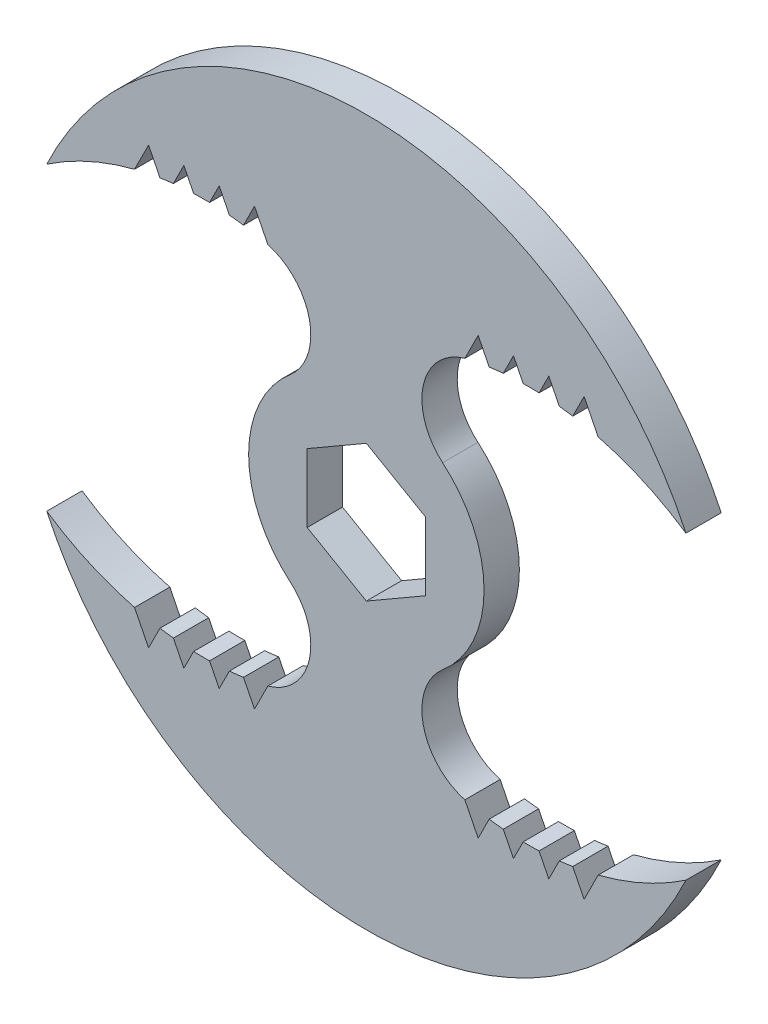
ISO-10303-21;
HEADER;
FILE_DESCRIPTION(('STEP AP214'),'2;1');
FILE_NAME('part.step','',(''),(''),'','','');
FILE_SCHEMA(('AUTOMOTIVE_DESIGN { 1 0 10303 214 1 1 1 1 }'));
ENDSEC;
DATA;
#1=APPLICATION_CONTEXT('core data for automotive mechanical design processes');
#2=APPLICATION_PROTOCOL_DEFINITION('international standard','automotive_design',2000,#1);
#3=PRODUCT_CONTEXT('',#1,'mechanical');
#4=PRODUCT('Part','Part','',(#3));
#5=PRODUCT_RELATED_PRODUCT_CATEGORY('part','',(#4));
#6=PRODUCT_DEFINITION_FORMATION('','',#4);
#7=PRODUCT_DEFINITION_CONTEXT('part definition',#1,'design');
#8=PRODUCT_DEFINITION('design','',#6,#7);
#9=PRODUCT_DEFINITION_SHAPE('','',#8);
#10=(LENGTH_UNIT() NAMED_UNIT(*) SI_UNIT(.MILLI.,.METRE.));
#11=(NAMED_UNIT(*) PLANE_ANGLE_UNIT() SI_UNIT($,.RADIAN.));
#12=(NAMED_UNIT(*) SI_UNIT($,.STERADIAN.) SOLID_ANGLE_UNIT());
#13=UNCERTAINTY_MEASURE_WITH_UNIT(LENGTH_MEASURE(1.E-05),#10,'distance_accuracy_value','');
#14=(GEOMETRIC_REPRESENTATION_CONTEXT(3) GLOBAL_UNCERTAINTY_ASSIGNED_CONTEXT((#13)) GLOBAL_UNIT_ASSIGNED_CONTEXT((#10,
#11,#12)) REPRESENTATION_CONTEXT('',''));
#15=CARTESIAN_POINT('',(0.,0.,0.));
#16=DIRECTION('',(0.,0.,1.));
#17=DIRECTION('',(1.,0.,0.));
#18=AXIS2_PLACEMENT_3D('',#15,#16,#17);
#19=CARTESIAN_POINT('',(27.5352931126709,14.0471790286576,5.99999999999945));
#20=DIRECTION('',(0.,0.,0.999999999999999));
#21=DIRECTION('',(1.00000000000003,0.,0.));
#22=AXIS2_PLACEMENT_3D('',#19,#20,#21);
#23=PLANE('',#22);
#24=CARTESIAN_POINT('',(27.5352931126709,14.0471790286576,5.99999999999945));
#25=DIRECTION('',(0.,0.,-0.999999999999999));
#26=DIRECTION('',(1.00000000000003,0.,0.));
#27=AXIS2_PLACEMENT_3D('',#24,#25,#26);
#28=CIRCLE('',#27,47.775);
#29=CARTESIAN_POINT('',(54.2985373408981,-25.5278052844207,6.00000000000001));
#30=VERTEX_POINT('',#29);
#31=CARTESIAN_POINT('',(39.3821580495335,-32.2356732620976,5.99999999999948));
#32=VERTEX_POINT('',#31);
#33=EDGE_CURVE('E587',#30,#32,#28,.T.);
#34=ORIENTED_EDGE('',*,*,#33,.T.);
#35=DIRECTION('',(-0.44721279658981,-0.894427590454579,0.));
#36=VECTOR('',#35,1.);
#37=CARTESIAN_POINT('',(39.3821580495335,-32.2356732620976,5.99999999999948));
#38=LINE('',#37,#36);
#39=CARTESIAN_POINT('',(37.0000000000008,-37.000000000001,5.99999999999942));
#40=VERTEX_POINT('',#39);
#41=EDGE_CURVE('E590',#32,#40,#38,.T.);
#42=ORIENTED_EDGE('',*,*,#41,.T.);
#43=DIRECTION('',(-0.447212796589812,0.894427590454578,0.));
#44=VECTOR('',#43,1.);
#45=CARTESIAN_POINT('',(37.0000000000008,-37.000000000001,5.99999999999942));
#46=LINE('',#45,#44);
#47=CARTESIAN_POINT('',(35.0653373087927,-33.1306659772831,5.99999999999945));
#48=VERTEX_POINT('',#47);
#49=EDGE_CURVE('E592',#40,#48,#46,.T.);
#50=ORIENTED_EDGE('',*,*,#49,.T.);
#51=CARTESIAN_POINT('',(27.5352931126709,14.0471790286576,5.99999999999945));
#52=DIRECTION('',(0.,0.,-0.999999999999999));
#53=DIRECTION('',(1.00000000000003,0.,0.));
#54=AXIS2_PLACEMENT_3D('',#51,#52,#53);
#55=CIRCLE('',#54,47.775);
#56=CARTESIAN_POINT('',(32.7804889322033,-33.4390141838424,5.99999999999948));
#57=VERTEX_POINT('',#56);
#58=EDGE_CURVE('E594',#48,#57,#55,.T.);
#59=ORIENTED_EDGE('',*,*,#58,.T.);
#60=DIRECTION('',(-0.447212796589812,-0.894427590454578,0.));
#61=VECTOR('',#60,1.);
#62=CARTESIAN_POINT('',(32.7804889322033,-33.4390141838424,5.99999999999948));
#63=LINE('',#62,#61);
#64=CARTESIAN_POINT('',(31.0000000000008,-37.0000000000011,5.99999999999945));
#65=VERTEX_POINT('',#64);
#66=EDGE_CURVE('E596',#57,#65,#63,.T.);
#67=ORIENTED_EDGE('',*,*,#66,.T.);
#68=DIRECTION('',(-0.447212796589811,0.894427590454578,0.));
#69=VECTOR('',#68,1.);
#70=CARTESIAN_POINT('',(31.0000000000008,-37.0000000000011,5.99999999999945));
#71=LINE('',#70,#69);
#72=CARTESIAN_POINT('',(29.3467372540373,-33.6934671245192,5.99999999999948));
#73=VERTEX_POINT('',#72);
#74=EDGE_CURVE('E598',#65,#73,#71,.T.);
#75=ORIENTED_EDGE('',*,*,#74,.T.);
#76=CARTESIAN_POINT('',(27.5352931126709,14.0471790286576,5.99999999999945));
#77=DIRECTION('',(0.,0.,-0.999999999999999));
#78=DIRECTION('',(1.00000000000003,0.,0.));
#79=AXIS2_PLACEMENT_3D('',#76,#77,#78);
#80=CIRCLE('',#79,47.775);
#81=CARTESIAN_POINT('',(26.6402780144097,-33.7194366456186,5.99999999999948));
#82=VERTEX_POINT('',#81);
#83=EDGE_CURVE('E600',#73,#82,#80,.T.);
#84=ORIENTED_EDGE('',*,*,#83,.T.);
#85=DIRECTION('',(-0.447212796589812,-0.894427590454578,0.));
#86=VECTOR('',#85,1.);
#87=CARTESIAN_POINT('',(26.6402780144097,-33.7194366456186,5.99999999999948));
#88=LINE('',#87,#86);
#89=CARTESIAN_POINT('',(25.0000000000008,-37.000000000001,5.99999999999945));
#90=VERTEX_POINT('',#89);
#91=EDGE_CURVE('E602',#82,#90,#88,.T.);
#92=ORIENTED_EDGE('',*,*,#91,.T.);
#93=DIRECTION('',(-0.4472127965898,0.89442759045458,0.));
#94=VECTOR('',#93,1.);
#95=CARTESIAN_POINT('',(25.0000000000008,-37.000000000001,5.99999999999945));
#96=LINE('',#95,#94);
#97=CARTESIAN_POINT('',(23.2684545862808,-33.5369014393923,5.99999999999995));
#98=VERTEX_POINT('',#97);
#99=EDGE_CURVE('E604',#90,#98,#96,.T.);
#100=ORIENTED_EDGE('',*,*,#99,.T.);
#101=CARTESIAN_POINT('',(27.5352931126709,14.0471790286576,5.99999999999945));
#102=DIRECTION('',(0.,0.,-0.999999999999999));
#103=DIRECTION('',(1.00000000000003,0.,0.));
#104=AXIS2_PLACEMENT_3D('',#101,#102,#103);
#105=CIRCLE('',#104,47.775);
#106=CARTESIAN_POINT('',(20.8697230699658,-33.2605455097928,5.99999999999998));
#107=VERTEX_POINT('',#106);
#108=EDGE_CURVE('E606',#98,#107,#105,.T.);
#109=ORIENTED_EDGE('',*,*,#108,.T.);
#110=DIRECTION('',(-0.447212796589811,-0.894427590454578,0.));
#111=VECTOR('',#110,1.);
#112=CARTESIAN_POINT('',(20.8697230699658,-33.2605455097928,5.99999999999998));
#113=LINE('',#112,#111);
#114=CARTESIAN_POINT('',(19.0000000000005,-37.0000000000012,5.99999999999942));
#115=VERTEX_POINT('',#114);
#116=EDGE_CURVE('E608',#107,#115,#113,.T.);
#117=ORIENTED_EDGE('',*,*,#116,.T.);
#118=DIRECTION('',(-0.447212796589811,0.894427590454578,0.));
#119=VECTOR('',#118,1.);
#120=CARTESIAN_POINT('',(19.0000000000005,-37.0000000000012,5.99999999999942));
#121=LINE('',#120,#119);
#122=CARTESIAN_POINT('',(16.7393450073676,-32.4786799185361,5.99999999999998));
#123=VERTEX_POINT('',#122);
#124=EDGE_CURVE('E610',#115,#123,#121,.T.);
#125=ORIENTED_EDGE('',*,*,#124,.T.);
#126=CARTESIAN_POINT('',(19.4390714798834,-22.8500000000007,5.99999999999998));
#127=DIRECTION('',(0.,0.,-0.999999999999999));
#128=DIRECTION('',(1.00000000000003,0.,0.));
#129=AXIS2_PLACEMENT_3D('',#126,#127,#128);
#130=CIRCLE('',#129,10.);
#131=CARTESIAN_POINT('',(12.959380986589,-15.2333333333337,6.00000000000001));
#132=VERTEX_POINT('',#131);
#133=EDGE_CURVE('E612',#123,#132,#130,.T.);
#134=ORIENTED_EDGE('',*,*,#133,.T.);
#135=CARTESIAN_POINT('',(0.,0.,5.99999999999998));
#136=DIRECTION('',(0.,0.,0.999999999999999));
#137=DIRECTION('',(1.00000000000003,0.,0.));
#138=AXIS2_PLACEMENT_3D('',#135,#136,#137);
#139=CIRCLE('',#138,20.);
#140=CARTESIAN_POINT('',(12.9593809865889,15.2333333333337,5.99999999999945));
#141=VERTEX_POINT('',#140);
#142=EDGE_CURVE('E614',#132,#141,#139,.T.);
#143=ORIENTED_EDGE('',*,*,#142,.T.);
#144=CARTESIAN_POINT('',(19.4390714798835,22.8500000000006,5.99999999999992));
#145=DIRECTION('',(0.,0.,-0.999999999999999));
#146=DIRECTION('',(1.00000000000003,0.,0.));
#147=AXIS2_PLACEMENT_3D('',#144,#145,#146);
#148=CIRCLE('',#147,10.);
#149=CARTESIAN_POINT('',(16.7393450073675,32.478679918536,5.99999999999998));
#150=VERTEX_POINT('',#149);
#151=EDGE_CURVE('E616',#141,#150,#148,.T.);
#152=ORIENTED_EDGE('',*,*,#151,.T.);
#153=DIRECTION('',(0.447212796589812,0.894427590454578,0.));
#154=VECTOR('',#153,1.);
#155=CARTESIAN_POINT('',(19.0000000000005,37.0000000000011,5.99999999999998));
#156=LINE('',#155,#154);
#157=CARTESIAN_POINT('',(19.0000000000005,37.0000000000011,5.99999999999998));
#158=VERTEX_POINT('',#157);
#159=EDGE_CURVE('E618',#150,#158,#156,.T.);
#160=ORIENTED_EDGE('',*,*,#159,.T.);
#161=DIRECTION('',(0.447212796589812,-0.894427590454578,0.));
#162=VECTOR('',#161,1.);
#163=CARTESIAN_POINT('',(20.8697230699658,33.2605455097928,5.99999999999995));
#164=LINE('',#163,#162);
#165=CARTESIAN_POINT('',(20.8697230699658,33.2605455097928,5.99999999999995));
#166=VERTEX_POINT('',#165);
#167=EDGE_CURVE('E620',#158,#166,#164,.T.);
#168=ORIENTED_EDGE('',*,*,#167,.T.);
#169=CARTESIAN_POINT('',(27.535293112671,-14.0471790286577,5.99999999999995));
#170=DIRECTION('',(0.,0.,-0.999999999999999));
#171=DIRECTION('',(1.00000000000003,0.,0.));
#172=AXIS2_PLACEMENT_3D('',#169,#170,#171);
#173=CIRCLE('',#172,47.775);
#174=CARTESIAN_POINT('',(23.2684545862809,33.5369014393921,5.99999999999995));
#175=VERTEX_POINT('',#174);
#176=EDGE_CURVE('E622',#166,#175,#173,.T.);
#177=ORIENTED_EDGE('',*,*,#176,.T.);
#178=DIRECTION('',(0.447212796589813,0.894427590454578,0.));
#179=VECTOR('',#178,1.);
#180=CARTESIAN_POINT('',(25.0000000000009,37.0000000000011,5.99999999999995));
#181=LINE('',#180,#179);
#182=CARTESIAN_POINT('',(25.0000000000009,37.0000000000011,5.99999999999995));
#183=VERTEX_POINT('',#182);
#184=EDGE_CURVE('E624',#175,#183,#181,.T.);
#185=ORIENTED_EDGE('',*,*,#184,.T.);
#186=DIRECTION('',(0.447212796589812,-0.894427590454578,0.));
#187=VECTOR('',#186,1.);
#188=CARTESIAN_POINT('',(26.6402780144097,33.7194366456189,5.99999999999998));
#189=LINE('',#188,#187);
#190=CARTESIAN_POINT('',(26.6402780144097,33.7194366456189,5.99999999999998));
#191=VERTEX_POINT('',#190);
#192=EDGE_CURVE('E626',#183,#191,#189,.T.);
#193=ORIENTED_EDGE('',*,*,#192,.T.);
#194=CARTESIAN_POINT('',(27.535293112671,-14.0471790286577,5.99999999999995));
#195=DIRECTION('',(0.,0.,-0.999999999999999));
#196=DIRECTION('',(1.00000000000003,0.,0.));
#197=AXIS2_PLACEMENT_3D('',#194,#195,#196);
#198=CIRCLE('',#197,47.775);
#199=CARTESIAN_POINT('',(29.3467372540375,33.6934671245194,5.99999999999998));
#200=VERTEX_POINT('',#199);
#201=EDGE_CURVE('E628',#191,#200,#198,.T.);
#202=ORIENTED_EDGE('',*,*,#201,.T.);
#203=DIRECTION('',(0.447212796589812,0.894427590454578,0.));
#204=VECTOR('',#203,1.);
#205=CARTESIAN_POINT('',(31.0000000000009,37.0000000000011,6.00000000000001));
#206=LINE('',#205,#204);
#207=CARTESIAN_POINT('',(31.0000000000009,37.0000000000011,6.00000000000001));
#208=VERTEX_POINT('',#207);
#209=EDGE_CURVE('E630',#200,#208,#206,.T.);
#210=ORIENTED_EDGE('',*,*,#209,.T.);
#211=DIRECTION('',(0.447212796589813,-0.894427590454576,0.));
#212=VECTOR('',#211,1.);
#213=CARTESIAN_POINT('',(32.7804889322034,33.4390141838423,5.99999999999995));
#214=LINE('',#213,#212);
#215=CARTESIAN_POINT('',(32.7804889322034,33.4390141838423,5.99999999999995));
#216=VERTEX_POINT('',#215);
#217=EDGE_CURVE('E632',#208,#216,#214,.T.);
#218=ORIENTED_EDGE('',*,*,#217,.T.);
#219=CARTESIAN_POINT('',(27.535293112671,-14.0471790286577,5.99999999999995));
#220=DIRECTION('',(0.,0.,-0.999999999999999));
#221=DIRECTION('',(1.00000000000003,0.,0.));
#222=AXIS2_PLACEMENT_3D('',#219,#220,#221);
#223=CIRCLE('',#222,47.775);
#224=CARTESIAN_POINT('',(35.0653373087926,33.130665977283,5.99999999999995));
#225=VERTEX_POINT('',#224);
#226=EDGE_CURVE('E634',#216,#225,#223,.T.);
#227=ORIENTED_EDGE('',*,*,#226,.T.);
#228=DIRECTION('',(0.447212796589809,0.894427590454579,0.));
#229=VECTOR('',#228,1.);
#230=CARTESIAN_POINT('',(37.000000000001,37.0000000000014,6.00000000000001));
#231=LINE('',#230,#229);
#232=CARTESIAN_POINT('',(37.000000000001,37.0000000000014,6.00000000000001));
#233=VERTEX_POINT('',#232);
#234=EDGE_CURVE('E636',#225,#233,#231,.T.);
#235=ORIENTED_EDGE('',*,*,#234,.T.);
#236=DIRECTION('',(0.44721279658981,-0.894427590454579,0.));
#237=VECTOR('',#236,1.);
#238=CARTESIAN_POINT('',(39.3821580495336,32.2356732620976,5.99999999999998));
#239=LINE('',#238,#237);
#240=CARTESIAN_POINT('',(39.3821580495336,32.2356732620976,5.99999999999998));
#241=VERTEX_POINT('',#240);
#242=EDGE_CURVE('E638',#233,#241,#239,.T.);
#243=ORIENTED_EDGE('',*,*,#242,.T.);
#244=CARTESIAN_POINT('',(27.535293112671,-14.0471790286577,5.99999999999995));
#245=DIRECTION('',(0.,0.,-0.999999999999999));
#246=DIRECTION('',(1.00000000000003,0.,0.));
#247=AXIS2_PLACEMENT_3D('',#244,#245,#246);
#248=CIRCLE('',#247,47.775);
#249=CARTESIAN_POINT('',(54.2985373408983,25.5278052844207,6.00000000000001));
#250=VERTEX_POINT('',#249);
#251=EDGE_CURVE('E640',#241,#250,#248,.T.);
#252=ORIENTED_EDGE('',*,*,#251,.T.);
#253=CARTESIAN_POINT('',(0.,0.,5.99999999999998));
#254=DIRECTION('',(0.,0.,0.999999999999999));
#255=DIRECTION('',(-1.00000000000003,0.,0.));
#256=AXIS2_PLACEMENT_3D('',#253,#254,#255);
#257=CIRCLE('',#256,60.);
#258=CARTESIAN_POINT('',(-54.2985373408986,25.5278052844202,5.99999999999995));
#259=VERTEX_POINT('',#258);
#260=EDGE_CURVE('E642',#250,#259,#257,.T.);
#261=ORIENTED_EDGE('',*,*,#260,.T.);
#262=CARTESIAN_POINT('',(-27.5352931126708,-14.0471790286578,6.00000000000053));
#263=DIRECTION('',(0.,0.,-0.999999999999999));
#264=DIRECTION('',(1.00000000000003,0.,0.));
#265=AXIS2_PLACEMENT_3D('',#262,#263,#264);
#266=CIRCLE('',#265,47.775);
#267=CARTESIAN_POINT('',(-39.3821580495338,32.2356732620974,6.00000000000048));
#268=VERTEX_POINT('',#267);
#269=EDGE_CURVE('E644',#259,#268,#266,.T.);
#270=ORIENTED_EDGE('',*,*,#269,.T.);
#271=DIRECTION('',(0.44721279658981,0.894427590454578,0.));
#272=VECTOR('',#271,1.);
#273=CARTESIAN_POINT('',(-37.0000000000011,37.0000000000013,6.0000000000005));
#274=LINE('',#273,#272);
#275=CARTESIAN_POINT('',(-37.0000000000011,37.0000000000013,6.0000000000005));
#276=VERTEX_POINT('',#275);
#277=EDGE_CURVE('E646',#268,#276,#274,.T.);
#278=ORIENTED_EDGE('',*,*,#277,.T.);
#279=DIRECTION('',(0.447212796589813,-0.894427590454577,0.));
#280=VECTOR('',#279,1.);
#281=CARTESIAN_POINT('',(-35.0653373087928,33.1306659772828,6.0000000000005));
#282=LINE('',#281,#280);
#283=CARTESIAN_POINT('',(-35.0653373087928,33.1306659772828,6.0000000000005));
#284=VERTEX_POINT('',#283);
#285=EDGE_CURVE('E648',#276,#284,#282,.T.);
#286=ORIENTED_EDGE('',*,*,#285,.T.);
#287=CARTESIAN_POINT('',(-27.5352931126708,-14.0471790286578,6.00000000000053));
#288=DIRECTION('',(0.,0.,-0.999999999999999));
#289=DIRECTION('',(1.00000000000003,0.,0.));
#290=AXIS2_PLACEMENT_3D('',#287,#288,#289);
#291=CIRCLE('',#290,47.775);
#292=CARTESIAN_POINT('',(-32.7804889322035,33.4390141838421,6.00000000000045));
#293=VERTEX_POINT('',#292);
#294=EDGE_CURVE('E650',#284,#293,#291,.T.);
#295=ORIENTED_EDGE('',*,*,#294,.T.);
#296=DIRECTION('',(0.447212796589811,0.894427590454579,0.));
#297=VECTOR('',#296,1.);
#298=CARTESIAN_POINT('',(-31.0000000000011,37.0000000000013,6.0000000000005));
#299=LINE('',#298,#297);
#300=CARTESIAN_POINT('',(-31.0000000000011,37.0000000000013,6.0000000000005));
#301=VERTEX_POINT('',#300);
#302=EDGE_CURVE('E652',#293,#301,#299,.T.);
#303=ORIENTED_EDGE('',*,*,#302,.T.);
#304=DIRECTION('',(0.447212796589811,-0.894427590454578,0.));
#305=VECTOR('',#304,1.);
#306=CARTESIAN_POINT('',(-29.3467372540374,33.693467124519,6.0000000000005));
#307=LINE('',#306,#305);
#308=CARTESIAN_POINT('',(-29.3467372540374,33.693467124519,6.0000000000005));
#309=VERTEX_POINT('',#308);
#310=EDGE_CURVE('E654',#301,#309,#307,.T.);
#311=ORIENTED_EDGE('',*,*,#310,.T.);
#312=CARTESIAN_POINT('',(-27.5352931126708,-14.0471790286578,6.00000000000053));
#313=DIRECTION('',(0.,0.,-0.999999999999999));
#314=DIRECTION('',(1.00000000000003,0.,0.));
#315=AXIS2_PLACEMENT_3D('',#312,#313,#314);
#316=CIRCLE('',#315,47.775);
#317=CARTESIAN_POINT('',(-26.6402780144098,33.7194366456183,6.0000000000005));
#318=VERTEX_POINT('',#317);
#319=EDGE_CURVE('E656',#309,#318,#316,.T.);
#320=ORIENTED_EDGE('',*,*,#319,.T.);
#321=DIRECTION('',(0.447212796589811,0.894427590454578,0.));
#322=VECTOR('',#321,1.);
#323=CARTESIAN_POINT('',(-25.0000000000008,37.0000000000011,6.00000000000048));
#324=LINE('',#323,#322);
#325=CARTESIAN_POINT('',(-25.0000000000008,37.0000000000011,6.00000000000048));
#326=VERTEX_POINT('',#325);
#327=EDGE_CURVE('E658',#318,#326,#324,.T.);
#328=ORIENTED_EDGE('',*,*,#327,.T.);
#329=DIRECTION('',(0.447212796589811,-0.894427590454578,0.));
#330=VECTOR('',#329,1.);
#331=CARTESIAN_POINT('',(-23.2684545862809,33.5369014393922,6.00000000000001));
#332=LINE('',#331,#330);
#333=CARTESIAN_POINT('',(-23.2684545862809,33.5369014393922,6.00000000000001));
#334=VERTEX_POINT('',#333);
#335=EDGE_CURVE('E660',#326,#334,#332,.T.);
#336=ORIENTED_EDGE('',*,*,#335,.T.);
#337=CARTESIAN_POINT('',(-27.5352931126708,-14.0471790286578,6.00000000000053));
#338=DIRECTION('',(0.,0.,-0.999999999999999));
#339=DIRECTION('',(1.00000000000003,0.,0.));
#340=AXIS2_PLACEMENT_3D('',#337,#338,#339);
#341=CIRCLE('',#340,47.775);
#342=CARTESIAN_POINT('',(-20.8697230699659,33.2605455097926,6.00000000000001));
#343=VERTEX_POINT('',#342);
#344=EDGE_CURVE('E662',#334,#343,#341,.T.);
#345=ORIENTED_EDGE('',*,*,#344,.T.);
#346=DIRECTION('',(0.44721279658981,0.894427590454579,0.));
#347=VECTOR('',#346,1.);
#348=CARTESIAN_POINT('',(-19.0000000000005,37.0000000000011,6.00000000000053));
#349=LINE('',#348,#347);
#350=CARTESIAN_POINT('',(-19.0000000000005,37.0000000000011,6.00000000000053));
#351=VERTEX_POINT('',#350);
#352=EDGE_CURVE('E664',#343,#351,#349,.T.);
#353=ORIENTED_EDGE('',*,*,#352,.T.);
#354=DIRECTION('',(0.447212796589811,-0.894427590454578,0.));
#355=VECTOR('',#354,1.);
#356=CARTESIAN_POINT('',(-16.7393450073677,32.4786799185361,5.99999999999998));
#357=LINE('',#356,#355);
#358=CARTESIAN_POINT('',(-16.7393450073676,32.478679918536,5.99999999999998));
#359=VERTEX_POINT('',#358);
#360=EDGE_CURVE('E666',#351,#359,#357,.T.);
#361=ORIENTED_EDGE('',*,*,#360,.T.);
#362=CARTESIAN_POINT('',(-19.4390714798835,22.8500000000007,5.99999999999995));
#363=DIRECTION('',(0.,0.,-0.999999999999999));
#364=DIRECTION('',(1.00000000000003,0.,0.));
#365=AXIS2_PLACEMENT_3D('',#362,#363,#364);
#366=CIRCLE('',#365,10.);
#367=CARTESIAN_POINT('',(-12.9593809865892,15.2333333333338,5.99999999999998));
#368=VERTEX_POINT('',#367);
#369=EDGE_CURVE('E668',#359,#368,#366,.T.);
#370=ORIENTED_EDGE('',*,*,#369,.T.);
#371=CARTESIAN_POINT('',(0.,0.,5.99999999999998));
#372=DIRECTION('',(0.,0.,0.999999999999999));
#373=DIRECTION('',(-1.00000000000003,0.,0.));
#374=AXIS2_PLACEMENT_3D('',#371,#372,#373);
#375=CIRCLE('',#374,20.);
#376=CARTESIAN_POINT('',(-12.9593809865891,-15.2333333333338,6.00000000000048));
#377=VERTEX_POINT('',#376);
#378=EDGE_CURVE('E670',#368,#377,#375,.T.);
#379=ORIENTED_EDGE('',*,*,#378,.T.);
#380=CARTESIAN_POINT('',(-19.4390714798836,-22.8500000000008,6.00000000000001));
#381=DIRECTION('',(0.,0.,-0.999999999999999));
#382=DIRECTION('',(1.00000000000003,0.,0.));
#383=AXIS2_PLACEMENT_3D('',#380,#381,#382);
#384=CIRCLE('',#383,10.);
#385=CARTESIAN_POINT('',(-16.7393450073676,-32.4786799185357,5.99999999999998));
#386=VERTEX_POINT('',#385);
#387=EDGE_CURVE('E672',#377,#386,#384,.T.);
#388=ORIENTED_EDGE('',*,*,#387,.T.);
#389=DIRECTION('',(-0.44721279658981,-0.894427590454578,0.));
#390=VECTOR('',#389,1.);
#391=CARTESIAN_POINT('',(-16.7393450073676,-32.4786799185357,5.99999999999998));
#392=LINE('',#391,#390);
#393=CARTESIAN_POINT('',(-19.0000000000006,-37.0000000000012,5.99999999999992));
#394=VERTEX_POINT('',#393);
#395=EDGE_CURVE('E674',#386,#394,#392,.T.);
#396=ORIENTED_EDGE('',*,*,#395,.T.);
#397=DIRECTION('',(-0.447212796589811,0.894427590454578,0.));
#398=VECTOR('',#397,1.);
#399=CARTESIAN_POINT('',(-19.0000000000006,-37.0000000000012,5.99999999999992));
#400=LINE('',#399,#398);
#401=CARTESIAN_POINT('',(-20.8697230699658,-33.2605455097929,6.00000000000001));
#402=VERTEX_POINT('',#401);
#403=EDGE_CURVE('E676',#394,#402,#400,.T.);
#404=ORIENTED_EDGE('',*,*,#403,.T.);
#405=CARTESIAN_POINT('',(-27.5352931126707,14.0471790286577,5.99999999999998));
#406=DIRECTION('',(0.,0.,-0.999999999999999));
#407=DIRECTION('',(1.00000000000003,0.,0.));
#408=AXIS2_PLACEMENT_3D('',#405,#406,#407);
#409=CIRCLE('',#408,47.775);
#410=CARTESIAN_POINT('',(-23.2684545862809,-33.5369014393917,5.99999999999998));
#411=VERTEX_POINT('',#410);
#412=EDGE_CURVE('E678',#402,#411,#409,.T.);
#413=ORIENTED_EDGE('',*,*,#412,.T.);
#414=DIRECTION('',(-0.44721279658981,-0.894427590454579,0.));
#415=VECTOR('',#414,1.);
#416=CARTESIAN_POINT('',(-23.2684545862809,-33.5369014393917,5.99999999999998));
#417=LINE('',#416,#415);
#418=CARTESIAN_POINT('',(-25.0000000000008,-37.0000000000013,5.99999999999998));
#419=VERTEX_POINT('',#418);
#420=EDGE_CURVE('E680',#411,#419,#417,.T.);
#421=ORIENTED_EDGE('',*,*,#420,.T.);
#422=DIRECTION('',(-0.447212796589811,0.894427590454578,0.));
#423=VECTOR('',#422,1.);
#424=CARTESIAN_POINT('',(-25.0000000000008,-37.0000000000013,5.99999999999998));
#425=LINE('',#424,#423);
#426=CARTESIAN_POINT('',(-26.6402780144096,-33.7194366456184,6.00000000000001));
#427=VERTEX_POINT('',#426);
#428=EDGE_CURVE('E682',#419,#427,#425,.T.);
#429=ORIENTED_EDGE('',*,*,#428,.T.);
#430=CARTESIAN_POINT('',(-27.5352931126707,14.0471790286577,5.99999999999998));
#431=DIRECTION('',(0.,0.,-0.999999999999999));
#432=DIRECTION('',(1.00000000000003,0.,0.));
#433=AXIS2_PLACEMENT_3D('',#430,#431,#432);
#434=CIRCLE('',#433,47.775);
#435=CARTESIAN_POINT('',(-29.3467372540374,-33.693467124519,5.99999999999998));
#436=VERTEX_POINT('',#435);
#437=EDGE_CURVE('E684',#427,#436,#434,.T.);
#438=ORIENTED_EDGE('',*,*,#437,.T.);
#439=DIRECTION('',(-0.447212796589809,-0.89442759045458,0.));
#440=VECTOR('',#439,1.);
#441=CARTESIAN_POINT('',(-29.3467372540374,-33.693467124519,5.99999999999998));
#442=LINE('',#441,#440);
#443=CARTESIAN_POINT('',(-31.000000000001,-37.0000000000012,5.99999999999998));
#444=VERTEX_POINT('',#443);
#445=EDGE_CURVE('E686',#436,#444,#442,.T.);
#446=ORIENTED_EDGE('',*,*,#445,.T.);
#447=DIRECTION('',(-0.447212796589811,0.894427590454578,0.));
#448=VECTOR('',#447,1.);
#449=CARTESIAN_POINT('',(-31.000000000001,-37.0000000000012,5.99999999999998));
#450=LINE('',#449,#448);
#451=CARTESIAN_POINT('',(-32.7804889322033,-33.4390141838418,5.99999999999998));
#452=VERTEX_POINT('',#451);
#453=EDGE_CURVE('E688',#444,#452,#450,.T.);
#454=ORIENTED_EDGE('',*,*,#453,.T.);
#455=CARTESIAN_POINT('',(-27.5352931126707,14.0471790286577,5.99999999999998));
#456=DIRECTION('',(0.,0.,-0.999999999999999));
#457=DIRECTION('',(1.00000000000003,0.,0.));
#458=AXIS2_PLACEMENT_3D('',#455,#456,#457);
#459=CIRCLE('',#458,47.775);
#460=CARTESIAN_POINT('',(-35.0653373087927,-33.1306659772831,5.99999999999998));
#461=VERTEX_POINT('',#460);
#462=EDGE_CURVE('E690',#452,#461,#459,.T.);
#463=ORIENTED_EDGE('',*,*,#462,.T.);
#464=DIRECTION('',(-0.447212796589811,-0.894427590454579,0.));
#465=VECTOR('',#464,1.);
#466=CARTESIAN_POINT('',(-37.0000000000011,-37.0000000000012,6.00000000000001));
#467=LINE('',#466,#465);
#468=CARTESIAN_POINT('',(-37.0000000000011,-37.0000000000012,6.00000000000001));
#469=VERTEX_POINT('',#468);
#470=EDGE_CURVE('E692',#461,#469,#467,.T.);
#471=ORIENTED_EDGE('',*,*,#470,.T.);
#472=DIRECTION('',(-0.447212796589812,0.894427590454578,0.));
#473=VECTOR('',#472,1.);
#474=CARTESIAN_POINT('',(-39.3821580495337,-32.2356732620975,6.00000000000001));
#475=LINE('',#474,#473);
#476=CARTESIAN_POINT('',(-39.3821580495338,-32.2356732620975,6.00000000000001));
#477=VERTEX_POINT('',#476);
#478=EDGE_CURVE('E694',#469,#477,#475,.T.);
#479=ORIENTED_EDGE('',*,*,#478,.T.);
#480=CARTESIAN_POINT('',(-27.5352931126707,14.0471790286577,5.99999999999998));
#481=DIRECTION('',(0.,0.,-0.999999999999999));
#482=DIRECTION('',(1.00000000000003,0.,0.));
#483=AXIS2_PLACEMENT_3D('',#480,#481,#482);
#484=CIRCLE('',#483,47.775);
#485=CARTESIAN_POINT('',(-54.2985373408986,-25.5278052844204,5.99999999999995));
#486=VERTEX_POINT('',#485);
#487=EDGE_CURVE('E696',#477,#486,#484,.T.);
#488=ORIENTED_EDGE('',*,*,#487,.T.);
#489=CARTESIAN_POINT('',(0.,0.,5.99999999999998));
#490=DIRECTION('',(0.,0.,0.999999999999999));
#491=DIRECTION('',(-1.00000000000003,0.,0.));
#492=AXIS2_PLACEMENT_3D('',#489,#490,#491);
#493=CIRCLE('',#492,60.);
#494=EDGE_CURVE('E698',#486,#30,#493,.T.);
#495=ORIENTED_EDGE('',*,*,#494,.T.);
#496=EDGE_LOOP('',(#34,#42,#50,#59,#67,#75,#84,#92,#100,#109,#117,#125,#134,#143,#152,#160,#168,
#177,#185,#193,#202,#210,#218,#227,#235,#243,#252,#261,#270,#278,#286,#295,#303,#311,#320,#328,
#336,#345,#353,#361,#370,#379,#388,#396,#404,#413,#421,#429,#438,#446,#454,#463,#471,#479,#488,#495));
#497=FACE_BOUND('',#496,.T.);
#498=DIRECTION('',(-0.866025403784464,-0.500000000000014,0.));
#499=VECTOR('',#498,1.);
#500=CARTESIAN_POINT('',(0.,11.6047404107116,5.99999999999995));
#501=LINE('',#500,#499);
#502=CARTESIAN_POINT('',(0.,11.6047404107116,5.99999999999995));
#503=VERTEX_POINT('',#502);
#504=CARTESIAN_POINT('',(-10.0500000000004,5.80237020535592,5.99999999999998));
#505=VERTEX_POINT('',#504);
#506=EDGE_CURVE('E457',#503,#505,#501,.T.);
#507=ORIENTED_EDGE('',*,*,#506,.F.);
#508=DIRECTION('',(-0.866025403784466,0.500000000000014,0.));
#509=VECTOR('',#508,1.);
#510=CARTESIAN_POINT('',(10.0500000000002,5.80237020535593,6.00000000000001));
#511=LINE('',#510,#509);
#512=CARTESIAN_POINT('',(10.0500000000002,5.80237020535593,6.00000000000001));
#513=VERTEX_POINT('',#512);
#514=EDGE_CURVE('E440',#513,#503,#511,.T.);
#515=ORIENTED_EDGE('',*,*,#514,.F.);
#516=DIRECTION('',(0.,1.00000000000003,0.));
#517=VECTOR('',#516,1.);
#518=CARTESIAN_POINT('',(10.0500000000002,-5.80237020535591,5.99999999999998));
#519=LINE('',#518,#517);
#520=CARTESIAN_POINT('',(10.0500000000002,-5.80237020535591,5.99999999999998));
#521=VERTEX_POINT('',#520);
#522=EDGE_CURVE('E465',#521,#513,#519,.T.);
#523=ORIENTED_EDGE('',*,*,#522,.F.);
#524=DIRECTION('',(0.866025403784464,0.500000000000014,0.));
#525=VECTOR('',#524,1.);
#526=CARTESIAN_POINT('',(0.,-11.6047404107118,5.99999999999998));
#527=LINE('',#526,#525);
#528=CARTESIAN_POINT('',(0.,-11.6047404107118,5.99999999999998));
#529=VERTEX_POINT('',#528);
#530=EDGE_CURVE('E463',#529,#521,#527,.T.);
#531=ORIENTED_EDGE('',*,*,#530,.F.);
#532=DIRECTION('',(0.866025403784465,-0.500000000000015,0.));
#533=VECTOR('',#532,1.);
#534=CARTESIAN_POINT('',(-10.0500000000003,-5.80237020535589,5.99999999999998));
#535=LINE('',#534,#533);
#536=CARTESIAN_POINT('',(-10.0500000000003,-5.80237020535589,5.99999999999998));
#537=VERTEX_POINT('',#536);
#538=EDGE_CURVE('E461',#537,#529,#535,.T.);
#539=ORIENTED_EDGE('',*,*,#538,.F.);
#540=DIRECTION('',(0.,-1.00000000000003,0.));
#541=VECTOR('',#540,1.);
#542=CARTESIAN_POINT('',(-10.0500000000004,5.80237020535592,5.99999999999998));
#543=LINE('',#542,#541);
#544=EDGE_CURVE('E459',#505,#537,#543,.T.);
#545=ORIENTED_EDGE('',*,*,#544,.F.);
#546=EDGE_LOOP('',(#507,#515,#523,#531,#539,#545));
#547=FACE_BOUND('',#546,.T.);
#548=ADVANCED_FACE('F36',(#497,#547),#23,.T.);
#549=CARTESIAN_POINT('',(27.5352931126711,14.0471790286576,-5.27355936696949E-13));
#550=DIRECTION('',(0.,0.,0.999999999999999));
#551=DIRECTION('',(1.00000000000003,0.,0.));
#552=AXIS2_PLACEMENT_3D('',#549,#550,#551);
#553=PLANE('',#552);
#554=CARTESIAN_POINT('',(27.5352931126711,14.0471790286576,-5.27355936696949E-13));
#555=DIRECTION('',(0.,0.,-0.999999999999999));
#556=DIRECTION('',(1.00000000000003,0.,0.));
#557=AXIS2_PLACEMENT_3D('',#554,#555,#556);
#558=CIRCLE('',#557,47.775);
#559=CARTESIAN_POINT('',(54.2985373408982,-25.5278052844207,0.));
#560=VERTEX_POINT('',#559);
#561=CARTESIAN_POINT('',(39.3821580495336,-32.2356732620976,-5.27355936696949E-13));
#562=VERTEX_POINT('',#561);
#563=EDGE_CURVE('E441',#560,#562,#558,.T.);
#564=ORIENTED_EDGE('',*,*,#563,.F.);
#565=CARTESIAN_POINT('',(0.,0.,0.));
#566=DIRECTION('',(0.,0.,0.999999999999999));
#567=DIRECTION('',(-1.00000000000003,0.,0.));
#568=AXIS2_PLACEMENT_3D('',#565,#566,#567);
#569=CIRCLE('',#568,60.);
#570=CARTESIAN_POINT('',(-54.2985373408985,-25.5278052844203,0.));
#571=VERTEX_POINT('',#570);
#572=EDGE_CURVE('E585',#571,#560,#569,.T.);
#573=ORIENTED_EDGE('',*,*,#572,.F.);
#574=CARTESIAN_POINT('',(-27.5352931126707,14.0471790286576,0.));
#575=DIRECTION('',(0.,0.,-0.999999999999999));
#576=DIRECTION('',(1.00000000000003,0.,0.));
#577=AXIS2_PLACEMENT_3D('',#574,#575,#576);
#578=CIRCLE('',#577,47.775);
#579=CARTESIAN_POINT('',(-39.3821580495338,-32.2356732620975,0.));
#580=VERTEX_POINT('',#579);
#581=EDGE_CURVE('E583',#580,#571,#578,.T.);
#582=ORIENTED_EDGE('',*,*,#581,.F.);
#583=DIRECTION('',(-0.447212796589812,0.894427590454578,0.));
#584=VECTOR('',#583,1.);
#585=CARTESIAN_POINT('',(-39.3821580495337,-32.2356732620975,0.));
#586=LINE('',#585,#584);
#587=CARTESIAN_POINT('',(-37.0000000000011,-37.0000000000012,0.));
#588=VERTEX_POINT('',#587);
#589=EDGE_CURVE('E581',#588,#580,#586,.T.);
#590=ORIENTED_EDGE('',*,*,#589,.F.);
#591=DIRECTION('',(-0.447212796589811,-0.894427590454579,0.));
#592=VECTOR('',#591,1.);
#593=CARTESIAN_POINT('',(-37.0000000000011,-37.0000000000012,0.));
#594=LINE('',#593,#592);
#595=CARTESIAN_POINT('',(-35.0653373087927,-33.1306659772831,0.));
#596=VERTEX_POINT('',#595);
#597=EDGE_CURVE('E579',#596,#588,#594,.T.);
#598=ORIENTED_EDGE('',*,*,#597,.F.);
#599=CARTESIAN_POINT('',(-27.5352931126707,14.0471790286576,0.));
#600=DIRECTION('',(0.,0.,-0.999999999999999));
#601=DIRECTION('',(1.00000000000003,0.,0.));
#602=AXIS2_PLACEMENT_3D('',#599,#600,#601);
#603=CIRCLE('',#602,47.775);
#604=CARTESIAN_POINT('',(-32.7804889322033,-33.4390141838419,0.));
#605=VERTEX_POINT('',#604);
#606=EDGE_CURVE('E577',#605,#596,#603,.T.);
#607=ORIENTED_EDGE('',*,*,#606,.F.);
#608=DIRECTION('',(-0.447212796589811,0.894427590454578,0.));
#609=VECTOR('',#608,1.);
#610=CARTESIAN_POINT('',(-31.0000000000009,-37.0000000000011,0.));
#611=LINE('',#610,#609);
#612=CARTESIAN_POINT('',(-31.0000000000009,-37.0000000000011,0.));
#613=VERTEX_POINT('',#612);
#614=EDGE_CURVE('E575',#613,#605,#611,.T.);
#615=ORIENTED_EDGE('',*,*,#614,.F.);
#616=DIRECTION('',(-0.447212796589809,-0.89442759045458,0.));
#617=VECTOR('',#616,1.);
#618=CARTESIAN_POINT('',(-29.3467372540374,-33.6934671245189,0.));
#619=LINE('',#618,#617);
#620=CARTESIAN_POINT('',(-29.3467372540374,-33.6934671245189,0.));
#621=VERTEX_POINT('',#620);
#622=EDGE_CURVE('E573',#621,#613,#619,.T.);
#623=ORIENTED_EDGE('',*,*,#622,.F.);
#624=CARTESIAN_POINT('',(-27.5352931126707,14.0471790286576,0.));
#625=DIRECTION('',(0.,0.,-0.999999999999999));
#626=DIRECTION('',(1.00000000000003,0.,0.));
#627=AXIS2_PLACEMENT_3D('',#624,#625,#626);
#628=CIRCLE('',#627,47.775);
#629=CARTESIAN_POINT('',(-26.6402780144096,-33.7194366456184,0.));
#630=VERTEX_POINT('',#629);
#631=EDGE_CURVE('E571',#630,#621,#628,.T.);
#632=ORIENTED_EDGE('',*,*,#631,.F.);
#633=DIRECTION('',(-0.447212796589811,0.894427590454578,0.));
#634=VECTOR('',#633,1.);
#635=CARTESIAN_POINT('',(-25.0000000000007,-37.0000000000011,0.));
#636=LINE('',#635,#634);
#637=CARTESIAN_POINT('',(-25.0000000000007,-37.0000000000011,0.));
#638=VERTEX_POINT('',#637);
#639=EDGE_CURVE('E569',#638,#630,#636,.T.);
#640=ORIENTED_EDGE('',*,*,#639,.F.);
#641=DIRECTION('',(-0.44721279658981,-0.894427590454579,0.));
#642=VECTOR('',#641,1.);
#643=CARTESIAN_POINT('',(-23.2684545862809,-33.5369014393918,0.));
#644=LINE('',#643,#642);
#645=CARTESIAN_POINT('',(-23.2684545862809,-33.5369014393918,0.));
#646=VERTEX_POINT('',#645);
#647=EDGE_CURVE('E567',#646,#638,#644,.T.);
#648=ORIENTED_EDGE('',*,*,#647,.F.);
#649=CARTESIAN_POINT('',(-27.5352931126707,14.0471790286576,0.));
#650=DIRECTION('',(0.,0.,-0.999999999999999));
#651=DIRECTION('',(1.00000000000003,0.,0.));
#652=AXIS2_PLACEMENT_3D('',#649,#650,#651);
#653=CIRCLE('',#652,47.775);
#654=CARTESIAN_POINT('',(-20.8697230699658,-33.2605455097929,0.));
#655=VERTEX_POINT('',#654);
#656=EDGE_CURVE('E565',#655,#646,#653,.T.);
#657=ORIENTED_EDGE('',*,*,#656,.F.);
#658=DIRECTION('',(-0.447212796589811,0.894427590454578,0.));
#659=VECTOR('',#658,1.);
#660=CARTESIAN_POINT('',(-19.0000000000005,-37.0000000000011,0.));
#661=LINE('',#660,#659);
#662=CARTESIAN_POINT('',(-19.0000000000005,-37.0000000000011,0.));
#663=VERTEX_POINT('',#662);
#664=EDGE_CURVE('E563',#663,#655,#661,.T.);
#665=ORIENTED_EDGE('',*,*,#664,.F.);
#666=DIRECTION('',(-0.44721279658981,-0.894427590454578,0.));
#667=VECTOR('',#666,1.);
#668=CARTESIAN_POINT('',(-16.7393450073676,-32.4786799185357,0.));
#669=LINE('',#668,#667);
#670=CARTESIAN_POINT('',(-16.7393450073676,-32.4786799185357,0.));
#671=VERTEX_POINT('',#670);
#672=EDGE_CURVE('E561',#671,#663,#669,.T.);
#673=ORIENTED_EDGE('',*,*,#672,.F.);
#674=CARTESIAN_POINT('',(-19.4390714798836,-22.8500000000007,0.));
#675=DIRECTION('',(0.,0.,-0.999999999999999));
#676=DIRECTION('',(1.00000000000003,0.,0.));
#677=AXIS2_PLACEMENT_3D('',#674,#675,#676);
#678=CIRCLE('',#677,10.);
#679=CARTESIAN_POINT('',(-12.959380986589,-15.2333333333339,4.71844785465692E-13));
#680=VERTEX_POINT('',#679);
#681=EDGE_CURVE('E559',#680,#671,#678,.T.);
#682=ORIENTED_EDGE('',*,*,#681,.F.);
#683=CARTESIAN_POINT('',(0.,0.,0.));
#684=DIRECTION('',(0.,0.,0.999999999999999));
#685=DIRECTION('',(-1.00000000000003,0.,0.));
#686=AXIS2_PLACEMENT_3D('',#683,#684,#685);
#687=CIRCLE('',#686,20.);
#688=CARTESIAN_POINT('',(-12.959380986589,15.2333333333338,0.));
#689=VERTEX_POINT('',#688);
#690=EDGE_CURVE('E557',#689,#680,#687,.T.);
#691=ORIENTED_EDGE('',*,*,#690,.F.);
#692=CARTESIAN_POINT('',(-19.4390714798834,22.8500000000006,0.));
#693=DIRECTION('',(0.,0.,-0.999999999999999));
#694=DIRECTION('',(1.00000000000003,0.,0.));
#695=AXIS2_PLACEMENT_3D('',#692,#693,#694);
#696=CIRCLE('',#695,10.);
#697=CARTESIAN_POINT('',(-16.7393450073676,32.478679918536,0.));
#698=VERTEX_POINT('',#697);
#699=EDGE_CURVE('E555',#698,#689,#696,.T.);
#700=ORIENTED_EDGE('',*,*,#699,.F.);
#701=DIRECTION('',(0.447212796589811,-0.894427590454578,0.));
#702=VECTOR('',#701,1.);
#703=CARTESIAN_POINT('',(-16.7393450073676,32.478679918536,0.));
#704=LINE('',#703,#702);
#705=CARTESIAN_POINT('',(-19.0000000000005,37.000000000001,4.9960036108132E-13));
#706=VERTEX_POINT('',#705);
#707=EDGE_CURVE('E553',#706,#698,#704,.T.);
#708=ORIENTED_EDGE('',*,*,#707,.F.);
#709=DIRECTION('',(0.44721279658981,0.894427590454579,0.));
#710=VECTOR('',#709,1.);
#711=CARTESIAN_POINT('',(-19.0000000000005,37.000000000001,4.9960036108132E-13));
#712=LINE('',#711,#710);
#713=CARTESIAN_POINT('',(-20.8697230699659,33.2605455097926,0.));
#714=VERTEX_POINT('',#713);
#715=EDGE_CURVE('E551',#714,#706,#712,.T.);
#716=ORIENTED_EDGE('',*,*,#715,.F.);
#717=CARTESIAN_POINT('',(-27.5352931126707,-14.0471790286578,5.27355936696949E-13));
#718=DIRECTION('',(0.,0.,-0.999999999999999));
#719=DIRECTION('',(1.00000000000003,0.,0.));
#720=AXIS2_PLACEMENT_3D('',#717,#718,#719);
#721=CIRCLE('',#720,47.775);
#722=CARTESIAN_POINT('',(-23.2684545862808,33.5369014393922,0.));
#723=VERTEX_POINT('',#722);
#724=EDGE_CURVE('E549',#723,#714,#721,.T.);
#725=ORIENTED_EDGE('',*,*,#724,.F.);
#726=DIRECTION('',(0.447212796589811,-0.894427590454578,0.));
#727=VECTOR('',#726,1.);
#728=CARTESIAN_POINT('',(-23.2684545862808,33.5369014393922,0.));
#729=LINE('',#728,#727);
#730=CARTESIAN_POINT('',(-25.0000000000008,37.0000000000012,4.71844785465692E-13));
#731=VERTEX_POINT('',#730);
#732=EDGE_CURVE('E547',#731,#723,#729,.T.);
#733=ORIENTED_EDGE('',*,*,#732,.F.);
#734=DIRECTION('',(0.447212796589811,0.894427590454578,0.));
#735=VECTOR('',#734,1.);
#736=CARTESIAN_POINT('',(-25.0000000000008,37.0000000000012,4.71844785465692E-13));
#737=LINE('',#736,#735);
#738=CARTESIAN_POINT('',(-26.6402780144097,33.7194366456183,4.9960036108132E-13));
#739=VERTEX_POINT('',#738);
#740=EDGE_CURVE('E545',#739,#731,#737,.T.);
#741=ORIENTED_EDGE('',*,*,#740,.F.);
#742=CARTESIAN_POINT('',(-27.5352931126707,-14.0471790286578,5.27355936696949E-13));
#743=DIRECTION('',(0.,0.,-0.999999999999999));
#744=DIRECTION('',(1.00000000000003,0.,0.));
#745=AXIS2_PLACEMENT_3D('',#742,#743,#744);
#746=CIRCLE('',#745,47.775);
#747=CARTESIAN_POINT('',(-29.3467372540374,33.6934671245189,5.27355936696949E-13));
#748=VERTEX_POINT('',#747);
#749=EDGE_CURVE('E543',#748,#739,#746,.T.);
#750=ORIENTED_EDGE('',*,*,#749,.F.);
#751=DIRECTION('',(0.447212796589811,-0.894427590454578,0.));
#752=VECTOR('',#751,1.);
#753=CARTESIAN_POINT('',(-29.3467372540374,33.6934671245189,5.27355936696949E-13));
#754=LINE('',#753,#752);
#755=CARTESIAN_POINT('',(-31.000000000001,37.0000000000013,5.27355936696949E-13));
#756=VERTEX_POINT('',#755);
#757=EDGE_CURVE('E541',#756,#748,#754,.T.);
#758=ORIENTED_EDGE('',*,*,#757,.F.);
#759=DIRECTION('',(0.447212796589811,0.894427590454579,0.));
#760=VECTOR('',#759,1.);
#761=CARTESIAN_POINT('',(-31.000000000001,37.0000000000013,5.27355936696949E-13));
#762=LINE('',#761,#760);
#763=CARTESIAN_POINT('',(-32.7804889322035,33.439014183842,4.71844785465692E-13));
#764=VERTEX_POINT('',#763);
#765=EDGE_CURVE('E539',#764,#756,#762,.T.);
#766=ORIENTED_EDGE('',*,*,#765,.F.);
#767=CARTESIAN_POINT('',(-27.5352931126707,-14.0471790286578,5.27355936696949E-13));
#768=DIRECTION('',(0.,0.,-0.999999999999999));
#769=DIRECTION('',(1.00000000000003,0.,0.));
#770=AXIS2_PLACEMENT_3D('',#767,#768,#769);
#771=CIRCLE('',#770,47.775);
#772=CARTESIAN_POINT('',(-35.0653373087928,33.1306659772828,4.9960036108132E-13));
#773=VERTEX_POINT('',#772);
#774=EDGE_CURVE('E537',#773,#764,#771,.T.);
#775=ORIENTED_EDGE('',*,*,#774,.F.);
#776=DIRECTION('',(0.447212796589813,-0.894427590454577,0.));
#777=VECTOR('',#776,1.);
#778=CARTESIAN_POINT('',(-35.0653373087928,33.1306659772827,4.9960036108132E-13));
#779=LINE('',#778,#777);
#780=CARTESIAN_POINT('',(-37.0000000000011,37.0000000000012,5.27355936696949E-13));
#781=VERTEX_POINT('',#780);
#782=EDGE_CURVE('E535',#781,#773,#779,.T.);
#783=ORIENTED_EDGE('',*,*,#782,.F.);
#784=DIRECTION('',(0.44721279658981,0.894427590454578,0.));
#785=VECTOR('',#784,1.);
#786=CARTESIAN_POINT('',(-37.0000000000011,37.0000000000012,5.27355936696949E-13));
#787=LINE('',#786,#785);
#788=CARTESIAN_POINT('',(-39.3821580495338,32.2356732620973,4.71844785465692E-13));
#789=VERTEX_POINT('',#788);
#790=EDGE_CURVE('E533',#789,#781,#787,.T.);
#791=ORIENTED_EDGE('',*,*,#790,.F.);
#792=CARTESIAN_POINT('',(-27.5352931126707,-14.0471790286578,5.27355936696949E-13));
#793=DIRECTION('',(0.,0.,-0.999999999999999));
#794=DIRECTION('',(1.00000000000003,0.,0.));
#795=AXIS2_PLACEMENT_3D('',#792,#793,#794);
#796=CIRCLE('',#795,47.775);
#797=CARTESIAN_POINT('',(-54.2985373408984,25.5278052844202,0.));
#798=VERTEX_POINT('',#797);
#799=EDGE_CURVE('E531',#798,#789,#796,.T.);
#800=ORIENTED_EDGE('',*,*,#799,.F.);
#801=CARTESIAN_POINT('',(0.,0.,0.));
#802=DIRECTION('',(0.,0.,0.999999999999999));
#803=DIRECTION('',(-1.00000000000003,0.,0.));
#804=AXIS2_PLACEMENT_3D('',#801,#802,#803);
#805=CIRCLE('',#804,60.);
#806=CARTESIAN_POINT('',(54.2985373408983,25.5278052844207,0.));
#807=VERTEX_POINT('',#806);
#808=EDGE_CURVE('E529',#807,#798,#805,.T.);
#809=ORIENTED_EDGE('',*,*,#808,.F.);
#810=CARTESIAN_POINT('',(27.5352931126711,-14.0471790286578,0.));
#811=DIRECTION('',(0.,0.,-0.999999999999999));
#812=DIRECTION('',(1.00000000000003,0.,0.));
#813=AXIS2_PLACEMENT_3D('',#810,#811,#812);
#814=CIRCLE('',#813,47.775);
#815=CARTESIAN_POINT('',(39.3821580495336,32.2356732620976,0.));
#816=VERTEX_POINT('',#815);
#817=EDGE_CURVE('E527',#816,#807,#814,.T.);
#818=ORIENTED_EDGE('',*,*,#817,.F.);
#819=DIRECTION('',(0.44721279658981,-0.894427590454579,0.));
#820=VECTOR('',#819,1.);
#821=CARTESIAN_POINT('',(39.3821580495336,32.2356732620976,0.));
#822=LINE('',#821,#820);
#823=CARTESIAN_POINT('',(37.000000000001,37.0000000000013,0.));
#824=VERTEX_POINT('',#823);
#825=EDGE_CURVE('E525',#824,#816,#822,.T.);
#826=ORIENTED_EDGE('',*,*,#825,.F.);
#827=DIRECTION('',(0.447212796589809,0.894427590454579,0.));
#828=VECTOR('',#827,1.);
#829=CARTESIAN_POINT('',(37.000000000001,37.0000000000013,0.));
#830=LINE('',#829,#828);
#831=CARTESIAN_POINT('',(35.0653373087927,33.130665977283,0.));
#832=VERTEX_POINT('',#831);
#833=EDGE_CURVE('E523',#832,#824,#830,.T.);
#834=ORIENTED_EDGE('',*,*,#833,.F.);
#835=CARTESIAN_POINT('',(27.5352931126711,-14.0471790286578,0.));
#836=DIRECTION('',(0.,0.,-0.999999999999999));
#837=DIRECTION('',(1.00000000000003,0.,0.));
#838=AXIS2_PLACEMENT_3D('',#835,#836,#837);
#839=CIRCLE('',#838,47.775);
#840=CARTESIAN_POINT('',(32.7804889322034,33.4390141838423,0.));
#841=VERTEX_POINT('',#840);
#842=EDGE_CURVE('E521',#841,#832,#839,.T.);
#843=ORIENTED_EDGE('',*,*,#842,.F.);
#844=DIRECTION('',(0.447212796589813,-0.894427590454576,0.));
#845=VECTOR('',#844,1.);
#846=CARTESIAN_POINT('',(32.7804889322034,33.4390141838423,0.));
#847=LINE('',#846,#845);
#848=CARTESIAN_POINT('',(31.000000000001,37.0000000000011,0.));
#849=VERTEX_POINT('',#848);
#850=EDGE_CURVE('E519',#849,#841,#847,.T.);
#851=ORIENTED_EDGE('',*,*,#850,.F.);
#852=DIRECTION('',(0.447212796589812,0.894427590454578,0.));
#853=VECTOR('',#852,1.);
#854=CARTESIAN_POINT('',(31.000000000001,37.0000000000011,0.));
#855=LINE('',#854,#853);
#856=CARTESIAN_POINT('',(29.3467372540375,33.6934671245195,0.));
#857=VERTEX_POINT('',#856);
#858=EDGE_CURVE('E517',#857,#849,#855,.T.);
#859=ORIENTED_EDGE('',*,*,#858,.F.);
#860=CARTESIAN_POINT('',(27.5352931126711,-14.0471790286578,0.));
#861=DIRECTION('',(0.,0.,-0.999999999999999));
#862=DIRECTION('',(1.00000000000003,0.,0.));
#863=AXIS2_PLACEMENT_3D('',#860,#861,#862);
#864=CIRCLE('',#863,47.775);
#865=CARTESIAN_POINT('',(26.6402780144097,33.7194366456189,0.));
#866=VERTEX_POINT('',#865);
#867=EDGE_CURVE('E515',#866,#857,#864,.T.);
#868=ORIENTED_EDGE('',*,*,#867,.F.);
#869=DIRECTION('',(0.447212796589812,-0.894427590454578,0.));
#870=VECTOR('',#869,1.);
#871=CARTESIAN_POINT('',(26.6402780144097,33.7194366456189,0.));
#872=LINE('',#871,#870);
#873=CARTESIAN_POINT('',(25.0000000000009,37.000000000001,0.));
#874=VERTEX_POINT('',#873);
#875=EDGE_CURVE('E513',#874,#866,#872,.T.);
#876=ORIENTED_EDGE('',*,*,#875,.F.);
#877=DIRECTION('',(0.447212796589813,0.894427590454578,0.));
#878=VECTOR('',#877,1.);
#879=CARTESIAN_POINT('',(25.0000000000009,37.000000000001,0.));
#880=LINE('',#879,#878);
#881=CARTESIAN_POINT('',(23.268454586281,33.5369014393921,0.));
#882=VERTEX_POINT('',#881);
#883=EDGE_CURVE('E511',#882,#874,#880,.T.);
#884=ORIENTED_EDGE('',*,*,#883,.F.);
#885=CARTESIAN_POINT('',(27.5352931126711,-14.0471790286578,0.));
#886=DIRECTION('',(0.,0.,-0.999999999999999));
#887=DIRECTION('',(1.00000000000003,0.,0.));
#888=AXIS2_PLACEMENT_3D('',#885,#886,#887);
#889=CIRCLE('',#888,47.775);
#890=CARTESIAN_POINT('',(20.8697230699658,33.2605455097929,0.));
#891=VERTEX_POINT('',#890);
#892=EDGE_CURVE('E509',#891,#882,#889,.T.);
#893=ORIENTED_EDGE('',*,*,#892,.F.);
#894=DIRECTION('',(0.447212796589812,-0.894427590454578,0.));
#895=VECTOR('',#894,1.);
#896=CARTESIAN_POINT('',(20.8697230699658,33.2605455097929,0.));
#897=LINE('',#896,#895);
#898=CARTESIAN_POINT('',(19.0000000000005,37.0000000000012,0.));
#899=VERTEX_POINT('',#898);
#900=EDGE_CURVE('E507',#899,#891,#897,.T.);
#901=ORIENTED_EDGE('',*,*,#900,.F.);
#902=DIRECTION('',(0.447212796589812,0.894427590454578,0.));
#903=VECTOR('',#902,1.);
#904=CARTESIAN_POINT('',(19.0000000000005,37.0000000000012,0.));
#905=LINE('',#904,#903);
#906=CARTESIAN_POINT('',(16.7393450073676,32.4786799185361,0.));
#907=VERTEX_POINT('',#906);
#908=EDGE_CURVE('E505',#907,#899,#905,.T.);
#909=ORIENTED_EDGE('',*,*,#908,.F.);
#910=CARTESIAN_POINT('',(19.4390714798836,22.8500000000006,0.));
#911=DIRECTION('',(0.,0.,-0.999999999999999));
#912=DIRECTION('',(1.00000000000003,0.,0.));
#913=AXIS2_PLACEMENT_3D('',#910,#911,#912);
#914=CIRCLE('',#913,10.);
#915=CARTESIAN_POINT('',(12.959380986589,15.2333333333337,-5.27355936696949E-13));
#916=VERTEX_POINT('',#915);
#917=EDGE_CURVE('E503',#916,#907,#914,.T.);
#918=ORIENTED_EDGE('',*,*,#917,.F.);
#919=CARTESIAN_POINT('',(0.,0.,0.));
#920=DIRECTION('',(0.,0.,0.999999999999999));
#921=DIRECTION('',(1.00000000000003,0.,0.));
#922=AXIS2_PLACEMENT_3D('',#919,#920,#921);
#923=CIRCLE('',#922,20.);
#924=CARTESIAN_POINT('',(12.9593809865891,-15.2333333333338,0.));
#925=VERTEX_POINT('',#924);
#926=EDGE_CURVE('E501',#925,#916,#923,.T.);
#927=ORIENTED_EDGE('',*,*,#926,.F.);
#928=CARTESIAN_POINT('',(19.4390714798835,-22.8500000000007,0.));
#929=DIRECTION('',(0.,0.,-0.999999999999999));
#930=DIRECTION('',(1.00000000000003,0.,0.));
#931=AXIS2_PLACEMENT_3D('',#928,#929,#930);
#932=CIRCLE('',#931,10.);
#933=CARTESIAN_POINT('',(16.7393450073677,-32.478679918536,0.));
#934=VERTEX_POINT('',#933);
#935=EDGE_CURVE('E499',#934,#925,#932,.T.);
#936=ORIENTED_EDGE('',*,*,#935,.F.);
#937=DIRECTION('',(-0.447212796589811,0.894427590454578,0.));
#938=VECTOR('',#937,1.);
#939=CARTESIAN_POINT('',(19.0000000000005,-37.000000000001,-5.55111512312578E-13));
#940=LINE('',#939,#938);
#941=CARTESIAN_POINT('',(19.0000000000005,-37.000000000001,-5.55111512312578E-13));
#942=VERTEX_POINT('',#941);
#943=EDGE_CURVE('E497',#942,#934,#940,.T.);
#944=ORIENTED_EDGE('',*,*,#943,.F.);
#945=DIRECTION('',(-0.447212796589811,-0.894427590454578,0.));
#946=VECTOR('',#945,1.);
#947=CARTESIAN_POINT('',(20.8697230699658,-33.2605455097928,0.));
#948=LINE('',#947,#946);
#949=CARTESIAN_POINT('',(20.8697230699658,-33.2605455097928,0.));
#950=VERTEX_POINT('',#949);
#951=EDGE_CURVE('E495',#950,#942,#948,.T.);
#952=ORIENTED_EDGE('',*,*,#951,.F.);
#953=CARTESIAN_POINT('',(27.5352931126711,14.0471790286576,-5.27355936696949E-13));
#954=DIRECTION('',(0.,0.,-0.999999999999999));
#955=DIRECTION('',(1.00000000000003,0.,0.));
#956=AXIS2_PLACEMENT_3D('',#953,#954,#955);
#957=CIRCLE('',#956,47.775);
#958=CARTESIAN_POINT('',(23.2684545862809,-33.5369014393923,0.));
#959=VERTEX_POINT('',#958);
#960=EDGE_CURVE('E493',#959,#950,#957,.T.);
#961=ORIENTED_EDGE('',*,*,#960,.F.);
#962=DIRECTION('',(-0.4472127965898,0.89442759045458,0.));
#963=VECTOR('',#962,1.);
#964=CARTESIAN_POINT('',(25.0000000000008,-37.0000000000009,-5.27355936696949E-13));
#965=LINE('',#964,#963);
#966=CARTESIAN_POINT('',(25.0000000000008,-37.0000000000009,-5.27355936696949E-13));
#967=VERTEX_POINT('',#966);
#968=EDGE_CURVE('E491',#967,#959,#965,.T.);
#969=ORIENTED_EDGE('',*,*,#968,.F.);
#970=DIRECTION('',(-0.447212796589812,-0.894427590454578,0.));
#971=VECTOR('',#970,1.);
#972=CARTESIAN_POINT('',(26.6402780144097,-33.7194366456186,-5.55111512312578E-13));
#973=LINE('',#972,#971);
#974=CARTESIAN_POINT('',(26.6402780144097,-33.7194366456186,-5.55111512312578E-13));
#975=VERTEX_POINT('',#974);
#976=EDGE_CURVE('E489',#975,#967,#973,.T.);
#977=ORIENTED_EDGE('',*,*,#976,.F.);
#978=CARTESIAN_POINT('',(27.5352931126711,14.0471790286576,-5.27355936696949E-13));
#979=DIRECTION('',(0.,0.,-0.999999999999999));
#980=DIRECTION('',(1.00000000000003,0.,0.));
#981=AXIS2_PLACEMENT_3D('',#978,#979,#980);
#982=CIRCLE('',#981,47.775);
#983=CARTESIAN_POINT('',(29.3467372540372,-33.6934671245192,-5.27355936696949E-13));
#984=VERTEX_POINT('',#983);
#985=EDGE_CURVE('E487',#984,#975,#982,.T.);
#986=ORIENTED_EDGE('',*,*,#985,.F.);
#987=DIRECTION('',(-0.447212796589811,0.894427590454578,0.));
#988=VECTOR('',#987,1.);
#989=CARTESIAN_POINT('',(31.0000000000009,-37.000000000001,-5.55111512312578E-13));
#990=LINE('',#989,#988);
#991=CARTESIAN_POINT('',(31.0000000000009,-37.000000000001,-5.55111512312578E-13));
#992=VERTEX_POINT('',#991);
#993=EDGE_CURVE('E485',#992,#984,#990,.T.);
#994=ORIENTED_EDGE('',*,*,#993,.F.);
#995=DIRECTION('',(-0.447212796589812,-0.894427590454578,0.));
#996=VECTOR('',#995,1.);
#997=CARTESIAN_POINT('',(32.7804889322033,-33.4390141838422,-5.27355936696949E-13));
#998=LINE('',#997,#996);
#999=CARTESIAN_POINT('',(32.7804889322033,-33.4390141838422,-5.27355936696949E-13));
#1000=VERTEX_POINT('',#999);
#1001=EDGE_CURVE('E483',#1000,#992,#998,.T.);
#1002=ORIENTED_EDGE('',*,*,#1001,.F.);
#1003=CARTESIAN_POINT('',(27.5352931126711,14.0471790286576,-5.27355936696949E-13));
#1004=DIRECTION('',(0.,0.,-0.999999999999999));
#1005=DIRECTION('',(1.00000000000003,0.,0.));
#1006=AXIS2_PLACEMENT_3D('',#1003,#1004,#1005);
#1007=CIRCLE('',#1006,47.775);
#1008=CARTESIAN_POINT('',(35.0653373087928,-33.1306659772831,-5.55111512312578E-13));
#1009=VERTEX_POINT('',#1008);
#1010=EDGE_CURVE('E481',#1009,#1000,#1007,.T.);
#1011=ORIENTED_EDGE('',*,*,#1010,.F.);
#1012=DIRECTION('',(-0.447212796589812,0.894427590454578,0.));
#1013=VECTOR('',#1012,1.);
#1014=CARTESIAN_POINT('',(37.000000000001,-37.0000000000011,-5.82867087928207E-13));
#1015=LINE('',#1014,#1013);
#1016=CARTESIAN_POINT('',(37.000000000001,-37.0000000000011,-5.82867087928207E-13));
#1017=VERTEX_POINT('',#1016);
#1018=EDGE_CURVE('E479',#1017,#1009,#1015,.T.);
#1019=ORIENTED_EDGE('',*,*,#1018,.F.);
#1020=DIRECTION('',(-0.44721279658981,-0.894427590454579,0.));
#1021=VECTOR('',#1020,1.);
#1022=CARTESIAN_POINT('',(39.3821580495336,-32.2356732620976,-5.27355936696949E-13));
#1023=LINE('',#1022,#1021);
#1024=EDGE_CURVE('E477',#562,#1017,#1023,.T.);
#1025=ORIENTED_EDGE('',*,*,#1024,.F.);
#1026=EDGE_LOOP('',(#564,#573,#582,#590,#598,#607,#615,#623,#632,#640,#648,#657,#665,#673,#682,
#691,#700,#708,#716,#725,#733,#741,#750,#758,#766,#775,#783,#791,#800,#809,#818,#826,#834,#843,
#851,#859,#868,#876,#884,#893,#901,#909,#918,#927,#936,#944,#952,#961,#969,#977,#986,#994,#1002,
#1011,#1019,#1025));
#1027=FACE_BOUND('',#1026,.T.);
#1028=DIRECTION('',(-0.866025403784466,0.500000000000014,0.));
#1029=VECTOR('',#1028,1.);
#1030=CARTESIAN_POINT('',(10.0500000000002,5.80237020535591,0.));
#1031=LINE('',#1030,#1029);
#1032=CARTESIAN_POINT('',(10.0500000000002,5.80237020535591,0.));
#1033=VERTEX_POINT('',#1032);
#1034=CARTESIAN_POINT('',(0.,11.6047404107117,0.));
#1035=VERTEX_POINT('',#1034);
#1036=EDGE_CURVE('E59',#1033,#1035,#1031,.T.);
#1037=ORIENTED_EDGE('',*,*,#1036,.T.);
#1038=DIRECTION('',(-0.866025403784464,-0.500000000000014,0.));
#1039=VECTOR('',#1038,1.);
#1040=CARTESIAN_POINT('',(0.,11.6047404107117,0.));
#1041=LINE('',#1040,#1039);
#1042=CARTESIAN_POINT('',(-10.0500000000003,5.80237020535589,0.));
#1043=VERTEX_POINT('',#1042);
#1044=EDGE_CURVE('E427',#1035,#1043,#1041,.T.);
#1045=ORIENTED_EDGE('',*,*,#1044,.T.);
#1046=DIRECTION('',(0.,-1.00000000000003,0.));
#1047=VECTOR('',#1046,1.);
#1048=CARTESIAN_POINT('',(-10.0500000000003,5.80237020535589,0.));
#1049=LINE('',#1048,#1047);
#1050=CARTESIAN_POINT('',(-10.0500000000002,-5.80237020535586,0.));
#1051=VERTEX_POINT('',#1050);
#1052=EDGE_CURVE('E436',#1043,#1051,#1049,.T.);
#1053=ORIENTED_EDGE('',*,*,#1052,.T.);
#1054=DIRECTION('',(0.866025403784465,-0.500000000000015,0.));
#1055=VECTOR('',#1054,1.);
#1056=CARTESIAN_POINT('',(-10.0500000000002,-5.80237020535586,0.));
#1057=LINE('',#1056,#1055);
#1058=CARTESIAN_POINT('',(0.,-11.6047404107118,0.));
#1059=VERTEX_POINT('',#1058);
#1060=EDGE_CURVE('E450',#1051,#1059,#1057,.T.);
#1061=ORIENTED_EDGE('',*,*,#1060,.T.);
#1062=DIRECTION('',(0.866025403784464,0.500000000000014,0.));
#1063=VECTOR('',#1062,1.);
#1064=CARTESIAN_POINT('',(0.,-11.6047404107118,0.));
#1065=LINE('',#1064,#1063);
#1066=CARTESIAN_POINT('',(10.0500000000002,-5.80237020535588,0.));
#1067=VERTEX_POINT('',#1066);
#1068=EDGE_CURVE('E453',#1059,#1067,#1065,.T.);
#1069=ORIENTED_EDGE('',*,*,#1068,.T.);
#1070=DIRECTION('',(0.,1.00000000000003,0.));
#1071=VECTOR('',#1070,1.);
#1072=CARTESIAN_POINT('',(10.0500000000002,-5.80237020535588,0.));
#1073=LINE('',#1072,#1071);
#1074=EDGE_CURVE('E446',#1067,#1033,#1073,.T.);
#1075=ORIENTED_EDGE('',*,*,#1074,.T.);
#1076=EDGE_LOOP('',(#1037,#1045,#1053,#1061,#1069,#1075));
#1077=FACE_BOUND('',#1076,.T.);
#1078=ADVANCED_FACE('F444',(#1027,#1077),#553,.F.);
#1079=CARTESIAN_POINT('',(27.5352931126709,14.0471790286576,5.99999999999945));
#1080=DIRECTION('',(0.,0.,-0.999999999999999));
#1081=DIRECTION('',(-1.00000000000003,0.,0.));
#1082=AXIS2_PLACEMENT_3D('',#1079,#1080,#1081);
#1083=CYLINDRICAL_SURFACE('',#1082,47.775);
#1084=ORIENTED_EDGE('',*,*,#563,.T.);
#1085=DIRECTION('',(0.,0.,-0.999999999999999));
#1086=VECTOR('',#1085,1.);
#1087=CARTESIAN_POINT('',(39.3821580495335,-32.2356732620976,5.99999999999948));
#1088=LINE('',#1087,#1086);
#1089=EDGE_CURVE('E11',#32,#562,#1088,.T.);
#1090=ORIENTED_EDGE('',*,*,#1089,.F.);
#1091=ORIENTED_EDGE('',*,*,#33,.F.);
#1092=DIRECTION('',(0.,0.,-0.999999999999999));
#1093=VECTOR('',#1092,1.);
#1094=CARTESIAN_POINT('',(54.2985373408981,-25.5278052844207,6.00000000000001));
#1095=LINE('',#1094,#1093);
#1096=EDGE_CURVE('E700',#30,#560,#1095,.T.);
#1097=ORIENTED_EDGE('',*,*,#1096,.T.);
#1098=EDGE_LOOP('',(#1084,#1090,#1091,#1097));
#1099=FACE_BOUND('',#1098,.T.);
#1100=ADVANCED_FACE('F38',(#1099),#1083,.F.);
#1101=CARTESIAN_POINT('',(39.3821580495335,-32.2356732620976,5.99999999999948));
#1102=DIRECTION('',(0.894427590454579,-0.44721279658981,0.));
#1103=DIRECTION('',(0.44721279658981,0.894427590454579,0.));
#1104=AXIS2_PLACEMENT_3D('',#1101,#1102,#1103);
#1105=PLANE('',#1104);
#1106=ORIENTED_EDGE('',*,*,#1024,.T.);
#1107=DIRECTION('',(0.,0.,-0.999999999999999));
#1108=VECTOR('',#1107,1.);
#1109=CARTESIAN_POINT('',(37.0000000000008,-37.000000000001,5.99999999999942));
#1110=LINE('',#1109,#1108);
#1111=EDGE_CURVE('E44',#40,#1017,#1110,.T.);
#1112=ORIENTED_EDGE('',*,*,#1111,.F.);
#1113=ORIENTED_EDGE('',*,*,#41,.F.);
#1114=ORIENTED_EDGE('',*,*,#1089,.T.);
#1115=EDGE_LOOP('',(#1106,#1112,#1113,#1114));
#1116=FACE_BOUND('',#1115,.T.);
#1117=ADVANCED_FACE('F888',(#1116),#1105,.F.);
#1118=CARTESIAN_POINT('',(37.0000000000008,-37.000000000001,5.99999999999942));
#1119=DIRECTION('',(-0.894427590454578,-0.447212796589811,0.));
#1120=DIRECTION('',(0.447212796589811,-0.894427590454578,0.));
#1121=AXIS2_PLACEMENT_3D('',#1118,#1119,#1120);
#1122=PLANE('',#1121);
#1123=ORIENTED_EDGE('',*,*,#1018,.T.);
#1124=DIRECTION('',(0.,0.,-0.999999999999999));
#1125=VECTOR('',#1124,1.);
#1126=CARTESIAN_POINT('',(35.0653373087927,-33.1306659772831,5.99999999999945));
#1127=LINE('',#1126,#1125);
#1128=EDGE_CURVE('E859',#48,#1009,#1127,.T.);
#1129=ORIENTED_EDGE('',*,*,#1128,.F.);
#1130=ORIENTED_EDGE('',*,*,#49,.F.);
#1131=ORIENTED_EDGE('',*,*,#1111,.T.);
#1132=EDGE_LOOP('',(#1123,#1129,#1130,#1131));
#1133=FACE_BOUND('',#1132,.T.);
#1134=ADVANCED_FACE('F866',(#1133),#1122,.F.);
#1135=CARTESIAN_POINT('',(27.5352931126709,14.0471790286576,5.99999999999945));
#1136=DIRECTION('',(0.,0.,-0.999999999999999));
#1137=DIRECTION('',(-1.00000000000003,0.,0.));
#1138=AXIS2_PLACEMENT_3D('',#1135,#1136,#1137);
#1139=CYLINDRICAL_SURFACE('',#1138,47.775);
#1140=ORIENTED_EDGE('',*,*,#1010,.T.);
#1141=DIRECTION('',(0.,0.,-0.999999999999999));
#1142=VECTOR('',#1141,1.);
#1143=CARTESIAN_POINT('',(32.7804889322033,-33.4390141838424,5.99999999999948));
#1144=LINE('',#1143,#1142);
#1145=EDGE_CURVE('E856',#57,#1000,#1144,.T.);
#1146=ORIENTED_EDGE('',*,*,#1145,.F.);
#1147=ORIENTED_EDGE('',*,*,#58,.F.);
#1148=ORIENTED_EDGE('',*,*,#1128,.T.);
#1149=EDGE_LOOP('',(#1140,#1146,#1147,#1148));
#1150=FACE_BOUND('',#1149,.T.);
#1151=ADVANCED_FACE('F876',(#1150),#1139,.F.);
#1152=CARTESIAN_POINT('',(32.7804889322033,-33.4390141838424,5.99999999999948));
#1153=DIRECTION('',(0.894427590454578,-0.447212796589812,0.));
#1154=DIRECTION('',(0.447212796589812,0.894427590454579,0.));
#1155=AXIS2_PLACEMENT_3D('',#1152,#1153,#1154);
#1156=PLANE('',#1155);
#1157=ORIENTED_EDGE('',*,*,#1001,.T.);
#1158=DIRECTION('',(0.,0.,-0.999999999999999));
#1159=VECTOR('',#1158,1.);
#1160=CARTESIAN_POINT('',(31.0000000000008,-37.0000000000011,5.99999999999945));
#1161=LINE('',#1160,#1159);
#1162=EDGE_CURVE('E853',#65,#992,#1161,.T.);
#1163=ORIENTED_EDGE('',*,*,#1162,.F.);
#1164=ORIENTED_EDGE('',*,*,#66,.F.);
#1165=ORIENTED_EDGE('',*,*,#1145,.T.);
#1166=EDGE_LOOP('',(#1157,#1163,#1164,#1165));
#1167=FACE_BOUND('',#1166,.T.);
#1168=ADVANCED_FACE('F880',(#1167),#1156,.F.);
#1169=CARTESIAN_POINT('',(31.0000000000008,-37.0000000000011,5.99999999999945));
#1170=DIRECTION('',(-0.894427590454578,-0.447212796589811,0.));
#1171=DIRECTION('',(0.447212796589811,-0.894427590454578,0.));
#1172=AXIS2_PLACEMENT_3D('',#1169,#1170,#1171);
#1173=PLANE('',#1172);
#1174=ORIENTED_EDGE('',*,*,#993,.T.);
#1175=DIRECTION('',(0.,0.,-0.999999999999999));
#1176=VECTOR('',#1175,1.);
#1177=CARTESIAN_POINT('',(29.3467372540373,-33.6934671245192,5.99999999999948));
#1178=LINE('',#1177,#1176);
#1179=EDGE_CURVE('E850',#73,#984,#1178,.T.);
#1180=ORIENTED_EDGE('',*,*,#1179,.F.);
#1181=ORIENTED_EDGE('',*,*,#74,.F.);
#1182=ORIENTED_EDGE('',*,*,#1162,.T.);
#1183=EDGE_LOOP('',(#1174,#1180,#1181,#1182));
#1184=FACE_BOUND('',#1183,.T.);
#1185=ADVANCED_FACE('F1141',(#1184),#1173,.F.);
#1186=CARTESIAN_POINT('',(27.5352931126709,14.0471790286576,5.99999999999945));
#1187=DIRECTION('',(0.,0.,-0.999999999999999));
#1188=DIRECTION('',(-1.00000000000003,0.,0.));
#1189=AXIS2_PLACEMENT_3D('',#1186,#1187,#1188);
#1190=CYLINDRICAL_SURFACE('',#1189,47.775);
#1191=ORIENTED_EDGE('',*,*,#985,.T.);
#1192=DIRECTION('',(0.,0.,-0.999999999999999));
#1193=VECTOR('',#1192,1.);
#1194=CARTESIAN_POINT('',(26.6402780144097,-33.7194366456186,5.99999999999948));
#1195=LINE('',#1194,#1193);
#1196=EDGE_CURVE('E847',#82,#975,#1195,.T.);
#1197=ORIENTED_EDGE('',*,*,#1196,.F.);
#1198=ORIENTED_EDGE('',*,*,#83,.F.);
#1199=ORIENTED_EDGE('',*,*,#1179,.T.);
#1200=EDGE_LOOP('',(#1191,#1197,#1198,#1199));
#1201=FACE_BOUND('',#1200,.T.);
#1202=ADVANCED_FACE('F1139',(#1201),#1190,.F.);
#1203=CARTESIAN_POINT('',(26.6402780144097,-33.7194366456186,5.99999999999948));
#1204=DIRECTION('',(0.894427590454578,-0.447212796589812,0.));
#1205=DIRECTION('',(0.447212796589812,0.894427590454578,0.));
#1206=AXIS2_PLACEMENT_3D('',#1203,#1204,#1205);
#1207=PLANE('',#1206);
#1208=ORIENTED_EDGE('',*,*,#976,.T.);
#1209=DIRECTION('',(0.,0.,-0.999999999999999));
#1210=VECTOR('',#1209,1.);
#1211=CARTESIAN_POINT('',(25.0000000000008,-37.000000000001,5.99999999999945));
#1212=LINE('',#1211,#1210);
#1213=EDGE_CURVE('E844',#90,#967,#1212,.T.);
#1214=ORIENTED_EDGE('',*,*,#1213,.F.);
#1215=ORIENTED_EDGE('',*,*,#91,.F.);
#1216=ORIENTED_EDGE('',*,*,#1196,.T.);
#1217=EDGE_LOOP('',(#1208,#1214,#1215,#1216));
#1218=FACE_BOUND('',#1217,.T.);
#1219=ADVANCED_FACE('F1134',(#1218),#1207,.F.);
#1220=CARTESIAN_POINT('',(25.0000000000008,-37.000000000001,5.99999999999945));
#1221=DIRECTION('',(-0.89442759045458,-0.447212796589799,0.));
#1222=DIRECTION('',(0.447212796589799,-0.89442759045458,0.));
#1223=AXIS2_PLACEMENT_3D('',#1220,#1221,#1222);
#1224=PLANE('',#1223);
#1225=ORIENTED_EDGE('',*,*,#968,.T.);
#1226=DIRECTION('',(0.,0.,-0.999999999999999));
#1227=VECTOR('',#1226,1.);
#1228=CARTESIAN_POINT('',(23.2684545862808,-33.5369014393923,5.99999999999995));
#1229=LINE('',#1228,#1227);
#1230=EDGE_CURVE('E841',#98,#959,#1229,.T.);
#1231=ORIENTED_EDGE('',*,*,#1230,.F.);
#1232=ORIENTED_EDGE('',*,*,#99,.F.);
#1233=ORIENTED_EDGE('',*,*,#1213,.T.);
#1234=EDGE_LOOP('',(#1225,#1231,#1232,#1233));
#1235=FACE_BOUND('',#1234,.T.);
#1236=ADVANCED_FACE('F1129',(#1235),#1224,.F.);
#1237=CARTESIAN_POINT('',(27.5352931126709,14.0471790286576,5.99999999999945));
#1238=DIRECTION('',(0.,0.,-0.999999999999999));
#1239=DIRECTION('',(-1.00000000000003,0.,0.));
#1240=AXIS2_PLACEMENT_3D('',#1237,#1238,#1239);
#1241=CYLINDRICAL_SURFACE('',#1240,47.775);
#1242=ORIENTED_EDGE('',*,*,#960,.T.);
#1243=DIRECTION('',(0.,0.,-0.999999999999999));
#1244=VECTOR('',#1243,1.);
#1245=CARTESIAN_POINT('',(20.8697230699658,-33.2605455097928,5.99999999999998));
#1246=LINE('',#1245,#1244);
#1247=EDGE_CURVE('E838',#107,#950,#1246,.T.);
#1248=ORIENTED_EDGE('',*,*,#1247,.F.);
#1249=ORIENTED_EDGE('',*,*,#108,.F.);
#1250=ORIENTED_EDGE('',*,*,#1230,.T.);
#1251=EDGE_LOOP('',(#1242,#1248,#1249,#1250));
#1252=FACE_BOUND('',#1251,.T.);
#1253=ADVANCED_FACE('F1125',(#1252),#1241,.F.);
#1254=CARTESIAN_POINT('',(20.8697230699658,-33.2605455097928,5.99999999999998));
#1255=DIRECTION('',(0.894427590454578,-0.447212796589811,0.));
#1256=DIRECTION('',(0.447212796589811,0.894427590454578,0.));
#1257=AXIS2_PLACEMENT_3D('',#1254,#1255,#1256);
#1258=PLANE('',#1257);
#1259=ORIENTED_EDGE('',*,*,#951,.T.);
#1260=DIRECTION('',(0.,0.,-0.999999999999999));
#1261=VECTOR('',#1260,1.);
#1262=CARTESIAN_POINT('',(19.0000000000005,-37.0000000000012,5.99999999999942));
#1263=LINE('',#1262,#1261);
#1264=EDGE_CURVE('E835',#115,#942,#1263,.T.);
#1265=ORIENTED_EDGE('',*,*,#1264,.F.);
#1266=ORIENTED_EDGE('',*,*,#116,.F.);
#1267=ORIENTED_EDGE('',*,*,#1247,.T.);
#1268=EDGE_LOOP('',(#1259,#1265,#1266,#1267));
#1269=FACE_BOUND('',#1268,.T.);
#1270=ADVANCED_FACE('F1120',(#1269),#1258,.F.);
#1271=CARTESIAN_POINT('',(19.0000000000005,-37.0000000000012,5.99999999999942));
#1272=DIRECTION('',(-0.894427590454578,-0.447212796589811,0.));
#1273=DIRECTION('',(0.447212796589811,-0.894427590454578,0.));
#1274=AXIS2_PLACEMENT_3D('',#1271,#1272,#1273);
#1275=PLANE('',#1274);
#1276=ORIENTED_EDGE('',*,*,#943,.T.);
#1277=DIRECTION('',(0.,0.,-0.999999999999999));
#1278=VECTOR('',#1277,1.);
#1279=CARTESIAN_POINT('',(16.7393450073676,-32.4786799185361,5.99999999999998));
#1280=LINE('',#1279,#1278);
#1281=EDGE_CURVE('E832',#123,#934,#1280,.T.);
#1282=ORIENTED_EDGE('',*,*,#1281,.F.);
#1283=ORIENTED_EDGE('',*,*,#124,.F.);
#1284=ORIENTED_EDGE('',*,*,#1264,.T.);
#1285=EDGE_LOOP('',(#1276,#1282,#1283,#1284));
#1286=FACE_BOUND('',#1285,.T.);
#1287=ADVANCED_FACE('F1114',(#1286),#1275,.F.);
#1288=CARTESIAN_POINT('',(19.4390714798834,-22.8500000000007,5.99999999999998));
#1289=DIRECTION('',(0.,0.,-0.999999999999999));
#1290=DIRECTION('',(-1.00000000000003,0.,0.));
#1291=AXIS2_PLACEMENT_3D('',#1288,#1289,#1290);
#1292=CYLINDRICAL_SURFACE('',#1291,10.);
#1293=ORIENTED_EDGE('',*,*,#935,.T.);
#1294=DIRECTION('',(0.,0.,-0.999999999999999));
#1295=VECTOR('',#1294,1.);
#1296=CARTESIAN_POINT('',(12.959380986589,-15.2333333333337,6.00000000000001));
#1297=LINE('',#1296,#1295);
#1298=EDGE_CURVE('E829',#132,#925,#1297,.T.);
#1299=ORIENTED_EDGE('',*,*,#1298,.F.);
#1300=ORIENTED_EDGE('',*,*,#133,.F.);
#1301=ORIENTED_EDGE('',*,*,#1281,.T.);
#1302=EDGE_LOOP('',(#1293,#1299,#1300,#1301));
#1303=FACE_BOUND('',#1302,.T.);
#1304=ADVANCED_FACE('F1110',(#1303),#1292,.F.);
#1305=CARTESIAN_POINT('',(0.,0.,5.99999999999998));
#1306=DIRECTION('',(0.,0.,-0.999999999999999));
#1307=DIRECTION('',(-1.00000000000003,0.,0.));
#1308=AXIS2_PLACEMENT_3D('',#1305,#1306,#1307);
#1309=CYLINDRICAL_SURFACE('',#1308,20.);
#1310=ORIENTED_EDGE('',*,*,#926,.T.);
#1311=DIRECTION('',(0.,0.,-0.999999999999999));
#1312=VECTOR('',#1311,1.);
#1313=CARTESIAN_POINT('',(12.9593809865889,15.2333333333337,5.99999999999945));
#1314=LINE('',#1313,#1312);
#1315=EDGE_CURVE('E826',#141,#916,#1314,.T.);
#1316=ORIENTED_EDGE('',*,*,#1315,.F.);
#1317=ORIENTED_EDGE('',*,*,#142,.F.);
#1318=ORIENTED_EDGE('',*,*,#1298,.T.);
#1319=EDGE_LOOP('',(#1310,#1316,#1317,#1318));
#1320=FACE_BOUND('',#1319,.T.);
#1321=ADVANCED_FACE('F1105',(#1320),#1309,.T.);
#1322=CARTESIAN_POINT('',(19.4390714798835,22.8500000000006,5.99999999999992));
#1323=DIRECTION('',(0.,0.,-0.999999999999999));
#1324=DIRECTION('',(-1.00000000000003,0.,0.));
#1325=AXIS2_PLACEMENT_3D('',#1322,#1323,#1324);
#1326=CYLINDRICAL_SURFACE('',#1325,10.);
#1327=ORIENTED_EDGE('',*,*,#917,.T.);
#1328=DIRECTION('',(0.,0.,-0.999999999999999));
#1329=VECTOR('',#1328,1.);
#1330=CARTESIAN_POINT('',(16.7393450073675,32.478679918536,5.99999999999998));
#1331=LINE('',#1330,#1329);
#1332=EDGE_CURVE('E823',#150,#907,#1331,.T.);
#1333=ORIENTED_EDGE('',*,*,#1332,.F.);
#1334=ORIENTED_EDGE('',*,*,#151,.F.);
#1335=ORIENTED_EDGE('',*,*,#1315,.T.);
#1336=EDGE_LOOP('',(#1327,#1333,#1334,#1335));
#1337=FACE_BOUND('',#1336,.T.);
#1338=ADVANCED_FACE('F1099',(#1337),#1326,.F.);
#1339=CARTESIAN_POINT('',(19.0000000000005,37.0000000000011,5.99999999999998));
#1340=DIRECTION('',(-0.894427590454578,0.447212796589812,0.));
#1341=DIRECTION('',(-0.447212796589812,-0.894427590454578,0.));
#1342=AXIS2_PLACEMENT_3D('',#1339,#1340,#1341);
#1343=PLANE('',#1342);
#1344=ORIENTED_EDGE('',*,*,#908,.T.);
#1345=DIRECTION('',(0.,0.,-0.999999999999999));
#1346=VECTOR('',#1345,1.);
#1347=CARTESIAN_POINT('',(19.0000000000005,37.0000000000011,5.99999999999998));
#1348=LINE('',#1347,#1346);
#1349=EDGE_CURVE('E820',#158,#899,#1348,.T.);
#1350=ORIENTED_EDGE('',*,*,#1349,.F.);
#1351=ORIENTED_EDGE('',*,*,#159,.F.);
#1352=ORIENTED_EDGE('',*,*,#1332,.T.);
#1353=EDGE_LOOP('',(#1344,#1350,#1351,#1352));
#1354=FACE_BOUND('',#1353,.T.);
#1355=ADVANCED_FACE('F1095',(#1354),#1343,.F.);
#1356=CARTESIAN_POINT('',(20.8697230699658,33.2605455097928,5.99999999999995));
#1357=DIRECTION('',(0.894427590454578,0.447212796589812,0.));
#1358=DIRECTION('',(-0.447212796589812,0.894427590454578,0.));
#1359=AXIS2_PLACEMENT_3D('',#1356,#1357,#1358);
#1360=PLANE('',#1359);
#1361=ORIENTED_EDGE('',*,*,#900,.T.);
#1362=DIRECTION('',(0.,0.,-0.999999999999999));
#1363=VECTOR('',#1362,1.);
#1364=CARTESIAN_POINT('',(20.8697230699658,33.2605455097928,5.99999999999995));
#1365=LINE('',#1364,#1363);
#1366=EDGE_CURVE('E817',#166,#891,#1365,.T.);
#1367=ORIENTED_EDGE('',*,*,#1366,.F.);
#1368=ORIENTED_EDGE('',*,*,#167,.F.);
#1369=ORIENTED_EDGE('',*,*,#1349,.T.);
#1370=EDGE_LOOP('',(#1361,#1367,#1368,#1369));
#1371=FACE_BOUND('',#1370,.T.);
#1372=ADVANCED_FACE('F1090',(#1371),#1360,.F.);
#1373=CARTESIAN_POINT('',(27.535293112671,-14.0471790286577,5.99999999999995));
#1374=DIRECTION('',(0.,0.,-0.999999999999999));
#1375=DIRECTION('',(-1.00000000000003,0.,0.));
#1376=AXIS2_PLACEMENT_3D('',#1373,#1374,#1375);
#1377=CYLINDRICAL_SURFACE('',#1376,47.775);
#1378=ORIENTED_EDGE('',*,*,#892,.T.);
#1379=DIRECTION('',(0.,0.,-0.999999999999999));
#1380=VECTOR('',#1379,1.);
#1381=CARTESIAN_POINT('',(23.2684545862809,33.5369014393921,5.99999999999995));
#1382=LINE('',#1381,#1380);
#1383=EDGE_CURVE('E814',#175,#882,#1382,.T.);
#1384=ORIENTED_EDGE('',*,*,#1383,.F.);
#1385=ORIENTED_EDGE('',*,*,#176,.F.);
#1386=ORIENTED_EDGE('',*,*,#1366,.T.);
#1387=EDGE_LOOP('',(#1378,#1384,#1385,#1386));
#1388=FACE_BOUND('',#1387,.T.);
#1389=ADVANCED_FACE('F1084',(#1388),#1377,.F.);
#1390=CARTESIAN_POINT('',(25.0000000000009,37.0000000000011,5.99999999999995));
#1391=DIRECTION('',(-0.894427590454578,0.447212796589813,0.));
#1392=DIRECTION('',(-0.447212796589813,-0.894427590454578,0.));
#1393=AXIS2_PLACEMENT_3D('',#1390,#1391,#1392);
#1394=PLANE('',#1393);
#1395=ORIENTED_EDGE('',*,*,#883,.T.);
#1396=DIRECTION('',(0.,0.,-0.999999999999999));
#1397=VECTOR('',#1396,1.);
#1398=CARTESIAN_POINT('',(25.0000000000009,37.0000000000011,5.99999999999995));
#1399=LINE('',#1398,#1397);
#1400=EDGE_CURVE('E811',#183,#874,#1399,.T.);
#1401=ORIENTED_EDGE('',*,*,#1400,.F.);
#1402=ORIENTED_EDGE('',*,*,#184,.F.);
#1403=ORIENTED_EDGE('',*,*,#1383,.T.);
#1404=EDGE_LOOP('',(#1395,#1401,#1402,#1403));
#1405=FACE_BOUND('',#1404,.T.);
#1406=ADVANCED_FACE('F1080',(#1405),#1394,.F.);
#1407=CARTESIAN_POINT('',(26.6402780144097,33.7194366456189,5.99999999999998));
#1408=DIRECTION('',(0.894427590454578,0.447212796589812,0.));
#1409=DIRECTION('',(-0.447212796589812,0.894427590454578,0.));
#1410=AXIS2_PLACEMENT_3D('',#1407,#1408,#1409);
#1411=PLANE('',#1410);
#1412=ORIENTED_EDGE('',*,*,#875,.T.);
#1413=DIRECTION('',(0.,0.,-0.999999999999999));
#1414=VECTOR('',#1413,1.);
#1415=CARTESIAN_POINT('',(26.6402780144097,33.7194366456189,5.99999999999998));
#1416=LINE('',#1415,#1414);
#1417=EDGE_CURVE('E808',#191,#866,#1416,.T.);
#1418=ORIENTED_EDGE('',*,*,#1417,.F.);
#1419=ORIENTED_EDGE('',*,*,#192,.F.);
#1420=ORIENTED_EDGE('',*,*,#1400,.T.);
#1421=EDGE_LOOP('',(#1412,#1418,#1419,#1420));
#1422=FACE_BOUND('',#1421,.T.);
#1423=ADVANCED_FACE('F1075',(#1422),#1411,.F.);
#1424=CARTESIAN_POINT('',(27.535293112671,-14.0471790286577,5.99999999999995));
#1425=DIRECTION('',(0.,0.,-0.999999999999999));
#1426=DIRECTION('',(-1.00000000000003,0.,0.));
#1427=AXIS2_PLACEMENT_3D('',#1424,#1425,#1426);
#1428=CYLINDRICAL_SURFACE('',#1427,47.775);
#1429=ORIENTED_EDGE('',*,*,#867,.T.);
#1430=DIRECTION('',(0.,0.,-0.999999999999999));
#1431=VECTOR('',#1430,1.);
#1432=CARTESIAN_POINT('',(29.3467372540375,33.6934671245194,5.99999999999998));
#1433=LINE('',#1432,#1431);
#1434=EDGE_CURVE('E805',#200,#857,#1433,.T.);
#1435=ORIENTED_EDGE('',*,*,#1434,.F.);
#1436=ORIENTED_EDGE('',*,*,#201,.F.);
#1437=ORIENTED_EDGE('',*,*,#1417,.T.);
#1438=EDGE_LOOP('',(#1429,#1435,#1436,#1437));
#1439=FACE_BOUND('',#1438,.T.);
#1440=ADVANCED_FACE('F1069',(#1439),#1428,.F.);
#1441=CARTESIAN_POINT('',(31.0000000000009,37.0000000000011,6.00000000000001));
#1442=DIRECTION('',(-0.894427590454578,0.447212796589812,0.));
#1443=DIRECTION('',(-0.447212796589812,-0.894427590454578,0.));
#1444=AXIS2_PLACEMENT_3D('',#1441,#1442,#1443);
#1445=PLANE('',#1444);
#1446=ORIENTED_EDGE('',*,*,#858,.T.);
#1447=DIRECTION('',(0.,0.,-0.999999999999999));
#1448=VECTOR('',#1447,1.);
#1449=CARTESIAN_POINT('',(31.0000000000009,37.0000000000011,6.00000000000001));
#1450=LINE('',#1449,#1448);
#1451=EDGE_CURVE('E802',#208,#849,#1450,.T.);
#1452=ORIENTED_EDGE('',*,*,#1451,.F.);
#1453=ORIENTED_EDGE('',*,*,#209,.F.);
#1454=ORIENTED_EDGE('',*,*,#1434,.T.);
#1455=EDGE_LOOP('',(#1446,#1452,#1453,#1454));
#1456=FACE_BOUND('',#1455,.T.);
#1457=ADVANCED_FACE('F1065',(#1456),#1445,.F.);
#1458=CARTESIAN_POINT('',(32.7804889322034,33.4390141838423,5.99999999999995));
#1459=DIRECTION('',(0.894427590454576,0.447212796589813,0.));
#1460=DIRECTION('',(-0.447212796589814,0.894427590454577,0.));
#1461=AXIS2_PLACEMENT_3D('',#1458,#1459,#1460);
#1462=PLANE('',#1461);
#1463=ORIENTED_EDGE('',*,*,#850,.T.);
#1464=DIRECTION('',(0.,0.,-0.999999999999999));
#1465=VECTOR('',#1464,1.);
#1466=CARTESIAN_POINT('',(32.7804889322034,33.4390141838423,5.99999999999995));
#1467=LINE('',#1466,#1465);
#1468=EDGE_CURVE('E799',#216,#841,#1467,.T.);
#1469=ORIENTED_EDGE('',*,*,#1468,.F.);
#1470=ORIENTED_EDGE('',*,*,#217,.F.);
#1471=ORIENTED_EDGE('',*,*,#1451,.T.);
#1472=EDGE_LOOP('',(#1463,#1469,#1470,#1471));
#1473=FACE_BOUND('',#1472,.T.);
#1474=ADVANCED_FACE('F1060',(#1473),#1462,.F.);
#1475=CARTESIAN_POINT('',(27.535293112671,-14.0471790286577,5.99999999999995));
#1476=DIRECTION('',(0.,0.,-0.999999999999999));
#1477=DIRECTION('',(-1.00000000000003,0.,0.));
#1478=AXIS2_PLACEMENT_3D('',#1475,#1476,#1477);
#1479=CYLINDRICAL_SURFACE('',#1478,47.775);
#1480=ORIENTED_EDGE('',*,*,#842,.T.);
#1481=DIRECTION('',(0.,0.,-0.999999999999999));
#1482=VECTOR('',#1481,1.);
#1483=CARTESIAN_POINT('',(35.0653373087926,33.130665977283,5.99999999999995));
#1484=LINE('',#1483,#1482);
#1485=EDGE_CURVE('E796',#225,#832,#1484,.T.);
#1486=ORIENTED_EDGE('',*,*,#1485,.F.);
#1487=ORIENTED_EDGE('',*,*,#226,.F.);
#1488=ORIENTED_EDGE('',*,*,#1468,.T.);
#1489=EDGE_LOOP('',(#1480,#1486,#1487,#1488));
#1490=FACE_BOUND('',#1489,.T.);
#1491=ADVANCED_FACE('F1054',(#1490),#1479,.F.);
#1492=CARTESIAN_POINT('',(37.000000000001,37.0000000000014,6.00000000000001));
#1493=DIRECTION('',(-0.894427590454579,0.447212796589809,0.));
#1494=DIRECTION('',(-0.447212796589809,-0.894427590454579,0.));
#1495=AXIS2_PLACEMENT_3D('',#1492,#1493,#1494);
#1496=PLANE('',#1495);
#1497=ORIENTED_EDGE('',*,*,#833,.T.);
#1498=DIRECTION('',(0.,0.,-0.999999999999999));
#1499=VECTOR('',#1498,1.);
#1500=CARTESIAN_POINT('',(37.000000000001,37.0000000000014,6.00000000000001));
#1501=LINE('',#1500,#1499);
#1502=EDGE_CURVE('E793',#233,#824,#1501,.T.);
#1503=ORIENTED_EDGE('',*,*,#1502,.F.);
#1504=ORIENTED_EDGE('',*,*,#234,.F.);
#1505=ORIENTED_EDGE('',*,*,#1485,.T.);
#1506=EDGE_LOOP('',(#1497,#1503,#1504,#1505));
#1507=FACE_BOUND('',#1506,.T.);
#1508=ADVANCED_FACE('F1050',(#1507),#1496,.F.);
#1509=CARTESIAN_POINT('',(39.3821580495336,32.2356732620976,5.99999999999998));
#1510=DIRECTION('',(0.894427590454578,0.44721279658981,0.));
#1511=DIRECTION('',(-0.447212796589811,0.894427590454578,0.));
#1512=AXIS2_PLACEMENT_3D('',#1509,#1510,#1511);
#1513=PLANE('',#1512);
#1514=ORIENTED_EDGE('',*,*,#825,.T.);
#1515=DIRECTION('',(0.,0.,-0.999999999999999));
#1516=VECTOR('',#1515,1.);
#1517=CARTESIAN_POINT('',(39.3821580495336,32.2356732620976,5.99999999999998));
#1518=LINE('',#1517,#1516);
#1519=EDGE_CURVE('E790',#241,#816,#1518,.T.);
#1520=ORIENTED_EDGE('',*,*,#1519,.F.);
#1521=ORIENTED_EDGE('',*,*,#242,.F.);
#1522=ORIENTED_EDGE('',*,*,#1502,.T.);
#1523=EDGE_LOOP('',(#1514,#1520,#1521,#1522));
#1524=FACE_BOUND('',#1523,.T.);
#1525=ADVANCED_FACE('F1045',(#1524),#1513,.F.);
#1526=CARTESIAN_POINT('',(27.535293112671,-14.0471790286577,5.99999999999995));
#1527=DIRECTION('',(0.,0.,-0.999999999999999));
#1528=DIRECTION('',(-1.00000000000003,0.,0.));
#1529=AXIS2_PLACEMENT_3D('',#1526,#1527,#1528);
#1530=CYLINDRICAL_SURFACE('',#1529,47.775);
#1531=ORIENTED_EDGE('',*,*,#817,.T.);
#1532=DIRECTION('',(0.,0.,-0.999999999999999));
#1533=VECTOR('',#1532,1.);
#1534=CARTESIAN_POINT('',(54.2985373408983,25.5278052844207,6.00000000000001));
#1535=LINE('',#1534,#1533);
#1536=EDGE_CURVE('E787',#250,#807,#1535,.T.);
#1537=ORIENTED_EDGE('',*,*,#1536,.F.);
#1538=ORIENTED_EDGE('',*,*,#251,.F.);
#1539=ORIENTED_EDGE('',*,*,#1519,.T.);
#1540=EDGE_LOOP('',(#1531,#1537,#1538,#1539));
#1541=FACE_BOUND('',#1540,.T.);
#1542=ADVANCED_FACE('F1039',(#1541),#1530,.F.);
#1543=CARTESIAN_POINT('',(0.,0.,5.99999999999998));
#1544=DIRECTION('',(0.,0.,-0.999999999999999));
#1545=DIRECTION('',(-1.00000000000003,0.,0.));
#1546=AXIS2_PLACEMENT_3D('',#1543,#1544,#1545);
#1547=CYLINDRICAL_SURFACE('',#1546,60.);
#1548=ORIENTED_EDGE('',*,*,#808,.T.);
#1549=DIRECTION('',(0.,0.,-0.999999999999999));
#1550=VECTOR('',#1549,1.);
#1551=CARTESIAN_POINT('',(-54.2985373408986,25.5278052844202,5.99999999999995));
#1552=LINE('',#1551,#1550);
#1553=EDGE_CURVE('E784',#259,#798,#1552,.T.);
#1554=ORIENTED_EDGE('',*,*,#1553,.F.);
#1555=ORIENTED_EDGE('',*,*,#260,.F.);
#1556=ORIENTED_EDGE('',*,*,#1536,.T.);
#1557=EDGE_LOOP('',(#1548,#1554,#1555,#1556));
#1558=FACE_BOUND('',#1557,.T.);
#1559=ADVANCED_FACE('F1035',(#1558),#1547,.T.);
#1560=CARTESIAN_POINT('',(-27.5352931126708,-14.0471790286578,6.00000000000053));
#1561=DIRECTION('',(0.,0.,-0.999999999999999));
#1562=DIRECTION('',(-1.00000000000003,0.,0.));
#1563=AXIS2_PLACEMENT_3D('',#1560,#1561,#1562);
#1564=CYLINDRICAL_SURFACE('',#1563,47.775);
#1565=ORIENTED_EDGE('',*,*,#799,.T.);
#1566=DIRECTION('',(0.,0.,-0.999999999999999));
#1567=VECTOR('',#1566,1.);
#1568=CARTESIAN_POINT('',(-39.3821580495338,32.2356732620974,6.00000000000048));
#1569=LINE('',#1568,#1567);
#1570=EDGE_CURVE('E781',#268,#789,#1569,.T.);
#1571=ORIENTED_EDGE('',*,*,#1570,.F.);
#1572=ORIENTED_EDGE('',*,*,#269,.F.);
#1573=ORIENTED_EDGE('',*,*,#1553,.T.);
#1574=EDGE_LOOP('',(#1565,#1571,#1572,#1573));
#1575=FACE_BOUND('',#1574,.T.);
#1576=ADVANCED_FACE('F1030',(#1575),#1564,.F.);
#1577=CARTESIAN_POINT('',(-37.0000000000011,37.0000000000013,6.0000000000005));
#1578=DIRECTION('',(-0.894427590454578,0.447212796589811,0.));
#1579=DIRECTION('',(-0.447212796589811,-0.894427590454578,0.));
#1580=AXIS2_PLACEMENT_3D('',#1577,#1578,#1579);
#1581=PLANE('',#1580);
#1582=ORIENTED_EDGE('',*,*,#790,.T.);
#1583=DIRECTION('',(0.,0.,-0.999999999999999));
#1584=VECTOR('',#1583,1.);
#1585=CARTESIAN_POINT('',(-37.0000000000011,37.0000000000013,6.0000000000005));
#1586=LINE('',#1585,#1584);
#1587=EDGE_CURVE('E778',#276,#781,#1586,.T.);
#1588=ORIENTED_EDGE('',*,*,#1587,.F.);
#1589=ORIENTED_EDGE('',*,*,#277,.F.);
#1590=ORIENTED_EDGE('',*,*,#1570,.T.);
#1591=EDGE_LOOP('',(#1582,#1588,#1589,#1590));
#1592=FACE_BOUND('',#1591,.T.);
#1593=ADVANCED_FACE('F1024',(#1592),#1581,.F.);
#1594=CARTESIAN_POINT('',(-35.0653373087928,33.1306659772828,6.0000000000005));
#1595=DIRECTION('',(0.894427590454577,0.447212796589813,0.));
#1596=DIRECTION('',(-0.447212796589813,0.894427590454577,0.));
#1597=AXIS2_PLACEMENT_3D('',#1594,#1595,#1596);
#1598=PLANE('',#1597);
#1599=ORIENTED_EDGE('',*,*,#782,.T.);
#1600=DIRECTION('',(0.,0.,-0.999999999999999));
#1601=VECTOR('',#1600,1.);
#1602=CARTESIAN_POINT('',(-35.0653373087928,33.1306659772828,6.0000000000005));
#1603=LINE('',#1602,#1601);
#1604=EDGE_CURVE('E775',#284,#773,#1603,.T.);
#1605=ORIENTED_EDGE('',*,*,#1604,.F.);
#1606=ORIENTED_EDGE('',*,*,#285,.F.);
#1607=ORIENTED_EDGE('',*,*,#1587,.T.);
#1608=EDGE_LOOP('',(#1599,#1605,#1606,#1607));
#1609=FACE_BOUND('',#1608,.T.);
#1610=ADVANCED_FACE('F1020',(#1609),#1598,.F.);
#1611=CARTESIAN_POINT('',(-27.5352931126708,-14.0471790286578,6.00000000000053));
#1612=DIRECTION('',(0.,0.,-0.999999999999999));
#1613=DIRECTION('',(-1.00000000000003,0.,0.));
#1614=AXIS2_PLACEMENT_3D('',#1611,#1612,#1613);
#1615=CYLINDRICAL_SURFACE('',#1614,47.775);
#1616=ORIENTED_EDGE('',*,*,#774,.T.);
#1617=DIRECTION('',(0.,0.,-0.999999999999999));
#1618=VECTOR('',#1617,1.);
#1619=CARTESIAN_POINT('',(-32.7804889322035,33.4390141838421,6.00000000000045));
#1620=LINE('',#1619,#1618);
#1621=EDGE_CURVE('E772',#293,#764,#1620,.T.);
#1622=ORIENTED_EDGE('',*,*,#1621,.F.);
#1623=ORIENTED_EDGE('',*,*,#294,.F.);
#1624=ORIENTED_EDGE('',*,*,#1604,.T.);
#1625=EDGE_LOOP('',(#1616,#1622,#1623,#1624));
#1626=FACE_BOUND('',#1625,.T.);
#1627=ADVANCED_FACE('F1015',(#1626),#1615,.F.);
#1628=CARTESIAN_POINT('',(-31.0000000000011,37.0000000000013,6.0000000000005));
#1629=DIRECTION('',(-0.894427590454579,0.447212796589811,0.));
#1630=DIRECTION('',(-0.447212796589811,-0.894427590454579,0.));
#1631=AXIS2_PLACEMENT_3D('',#1628,#1629,#1630);
#1632=PLANE('',#1631);
#1633=ORIENTED_EDGE('',*,*,#765,.T.);
#1634=DIRECTION('',(0.,0.,-0.999999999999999));
#1635=VECTOR('',#1634,1.);
#1636=CARTESIAN_POINT('',(-31.0000000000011,37.0000000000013,6.0000000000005));
#1637=LINE('',#1636,#1635);
#1638=EDGE_CURVE('E769',#301,#756,#1637,.T.);
#1639=ORIENTED_EDGE('',*,*,#1638,.F.);
#1640=ORIENTED_EDGE('',*,*,#302,.F.);
#1641=ORIENTED_EDGE('',*,*,#1621,.T.);
#1642=EDGE_LOOP('',(#1633,#1639,#1640,#1641));
#1643=FACE_BOUND('',#1642,.T.);
#1644=ADVANCED_FACE('F1009',(#1643),#1632,.F.);
#1645=CARTESIAN_POINT('',(-29.3467372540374,33.693467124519,6.0000000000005));
#1646=DIRECTION('',(0.894427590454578,0.447212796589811,0.));
#1647=DIRECTION('',(-0.447212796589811,0.894427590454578,0.));
#1648=AXIS2_PLACEMENT_3D('',#1645,#1646,#1647);
#1649=PLANE('',#1648);
#1650=ORIENTED_EDGE('',*,*,#757,.T.);
#1651=DIRECTION('',(0.,0.,-0.999999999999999));
#1652=VECTOR('',#1651,1.);
#1653=CARTESIAN_POINT('',(-29.3467372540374,33.693467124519,6.0000000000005));
#1654=LINE('',#1653,#1652);
#1655=EDGE_CURVE('E766',#309,#748,#1654,.T.);
#1656=ORIENTED_EDGE('',*,*,#1655,.F.);
#1657=ORIENTED_EDGE('',*,*,#310,.F.);
#1658=ORIENTED_EDGE('',*,*,#1638,.T.);
#1659=EDGE_LOOP('',(#1650,#1656,#1657,#1658));
#1660=FACE_BOUND('',#1659,.T.);
#1661=ADVANCED_FACE('F1005',(#1660),#1649,.F.);
#1662=CARTESIAN_POINT('',(-27.5352931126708,-14.0471790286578,6.00000000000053));
#1663=DIRECTION('',(0.,0.,-0.999999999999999));
#1664=DIRECTION('',(-1.00000000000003,0.,0.));
#1665=AXIS2_PLACEMENT_3D('',#1662,#1663,#1664);
#1666=CYLINDRICAL_SURFACE('',#1665,47.775);
#1667=ORIENTED_EDGE('',*,*,#749,.T.);
#1668=DIRECTION('',(0.,0.,-0.999999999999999));
#1669=VECTOR('',#1668,1.);
#1670=CARTESIAN_POINT('',(-26.6402780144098,33.7194366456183,6.0000000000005));
#1671=LINE('',#1670,#1669);
#1672=EDGE_CURVE('E763',#318,#739,#1671,.T.);
#1673=ORIENTED_EDGE('',*,*,#1672,.F.);
#1674=ORIENTED_EDGE('',*,*,#319,.F.);
#1675=ORIENTED_EDGE('',*,*,#1655,.T.);
#1676=EDGE_LOOP('',(#1667,#1673,#1674,#1675));
#1677=FACE_BOUND('',#1676,.T.);
#1678=ADVANCED_FACE('F1000',(#1677),#1666,.F.);
#1679=CARTESIAN_POINT('',(-25.0000000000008,37.0000000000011,6.00000000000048));
#1680=DIRECTION('',(-0.894427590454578,0.447212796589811,0.));
#1681=DIRECTION('',(-0.447212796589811,-0.894427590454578,0.));
#1682=AXIS2_PLACEMENT_3D('',#1679,#1680,#1681);
#1683=PLANE('',#1682);
#1684=ORIENTED_EDGE('',*,*,#740,.T.);
#1685=DIRECTION('',(0.,0.,-0.999999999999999));
#1686=VECTOR('',#1685,1.);
#1687=CARTESIAN_POINT('',(-25.0000000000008,37.0000000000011,6.00000000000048));
#1688=LINE('',#1687,#1686);
#1689=EDGE_CURVE('E760',#326,#731,#1688,.T.);
#1690=ORIENTED_EDGE('',*,*,#1689,.F.);
#1691=ORIENTED_EDGE('',*,*,#327,.F.);
#1692=ORIENTED_EDGE('',*,*,#1672,.T.);
#1693=EDGE_LOOP('',(#1684,#1690,#1691,#1692));
#1694=FACE_BOUND('',#1693,.T.);
#1695=ADVANCED_FACE('F994',(#1694),#1683,.F.);
#1696=CARTESIAN_POINT('',(-23.2684545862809,33.5369014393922,6.00000000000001));
#1697=DIRECTION('',(0.894427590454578,0.447212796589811,0.));
#1698=DIRECTION('',(-0.447212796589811,0.894427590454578,0.));
#1699=AXIS2_PLACEMENT_3D('',#1696,#1697,#1698);
#1700=PLANE('',#1699);
#1701=ORIENTED_EDGE('',*,*,#732,.T.);
#1702=DIRECTION('',(0.,0.,-0.999999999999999));
#1703=VECTOR('',#1702,1.);
#1704=CARTESIAN_POINT('',(-23.2684545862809,33.5369014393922,6.00000000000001));
#1705=LINE('',#1704,#1703);
#1706=EDGE_CURVE('E757',#334,#723,#1705,.T.);
#1707=ORIENTED_EDGE('',*,*,#1706,.F.);
#1708=ORIENTED_EDGE('',*,*,#335,.F.);
#1709=ORIENTED_EDGE('',*,*,#1689,.T.);
#1710=EDGE_LOOP('',(#1701,#1707,#1708,#1709));
#1711=FACE_BOUND('',#1710,.T.);
#1712=ADVANCED_FACE('F990',(#1711),#1700,.F.);
#1713=CARTESIAN_POINT('',(-27.5352931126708,-14.0471790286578,6.00000000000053));
#1714=DIRECTION('',(0.,0.,-0.999999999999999));
#1715=DIRECTION('',(-1.00000000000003,0.,0.));
#1716=AXIS2_PLACEMENT_3D('',#1713,#1714,#1715);
#1717=CYLINDRICAL_SURFACE('',#1716,47.775);
#1718=ORIENTED_EDGE('',*,*,#724,.T.);
#1719=DIRECTION('',(0.,0.,-0.999999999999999));
#1720=VECTOR('',#1719,1.);
#1721=CARTESIAN_POINT('',(-20.8697230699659,33.2605455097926,6.00000000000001));
#1722=LINE('',#1721,#1720);
#1723=EDGE_CURVE('E754',#343,#714,#1722,.T.);
#1724=ORIENTED_EDGE('',*,*,#1723,.F.);
#1725=ORIENTED_EDGE('',*,*,#344,.F.);
#1726=ORIENTED_EDGE('',*,*,#1706,.T.);
#1727=EDGE_LOOP('',(#1718,#1724,#1725,#1726));
#1728=FACE_BOUND('',#1727,.T.);
#1729=ADVANCED_FACE('F985',(#1728),#1717,.F.);
#1730=CARTESIAN_POINT('',(-19.0000000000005,37.0000000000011,6.00000000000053));
#1731=DIRECTION('',(-0.894427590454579,0.44721279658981,0.));
#1732=DIRECTION('',(-0.44721279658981,-0.894427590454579,0.));
#1733=AXIS2_PLACEMENT_3D('',#1730,#1731,#1732);
#1734=PLANE('',#1733);
#1735=ORIENTED_EDGE('',*,*,#715,.T.);
#1736=DIRECTION('',(0.,0.,-0.999999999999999));
#1737=VECTOR('',#1736,1.);
#1738=CARTESIAN_POINT('',(-19.0000000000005,37.0000000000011,6.00000000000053));
#1739=LINE('',#1738,#1737);
#1740=EDGE_CURVE('E751',#351,#706,#1739,.T.);
#1741=ORIENTED_EDGE('',*,*,#1740,.F.);
#1742=ORIENTED_EDGE('',*,*,#352,.F.);
#1743=ORIENTED_EDGE('',*,*,#1723,.T.);
#1744=EDGE_LOOP('',(#1735,#1741,#1742,#1743));
#1745=FACE_BOUND('',#1744,.T.);
#1746=ADVANCED_FACE('F979',(#1745),#1734,.F.);
#1747=CARTESIAN_POINT('',(-16.7393450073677,32.4786799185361,5.99999999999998));
#1748=DIRECTION('',(0.894427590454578,0.447212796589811,0.));
#1749=DIRECTION('',(-0.447212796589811,0.894427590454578,0.));
#1750=AXIS2_PLACEMENT_3D('',#1747,#1748,#1749);
#1751=PLANE('',#1750);
#1752=ORIENTED_EDGE('',*,*,#707,.T.);
#1753=DIRECTION('',(0.,0.,-0.999999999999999));
#1754=VECTOR('',#1753,1.);
#1755=CARTESIAN_POINT('',(-16.7393450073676,32.478679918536,5.99999999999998));
#1756=LINE('',#1755,#1754);
#1757=EDGE_CURVE('E748',#359,#698,#1756,.T.);
#1758=ORIENTED_EDGE('',*,*,#1757,.F.);
#1759=ORIENTED_EDGE('',*,*,#360,.F.);
#1760=ORIENTED_EDGE('',*,*,#1740,.T.);
#1761=EDGE_LOOP('',(#1752,#1758,#1759,#1760));
#1762=FACE_BOUND('',#1761,.T.);
#1763=ADVANCED_FACE('F975',(#1762),#1751,.F.);
#1764=CARTESIAN_POINT('',(-19.4390714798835,22.8500000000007,5.99999999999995));
#1765=DIRECTION('',(0.,0.,-0.999999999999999));
#1766=DIRECTION('',(-1.00000000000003,0.,0.));
#1767=AXIS2_PLACEMENT_3D('',#1764,#1765,#1766);
#1768=CYLINDRICAL_SURFACE('',#1767,10.);
#1769=ORIENTED_EDGE('',*,*,#699,.T.);
#1770=DIRECTION('',(0.,0.,-0.999999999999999));
#1771=VECTOR('',#1770,1.);
#1772=CARTESIAN_POINT('',(-12.9593809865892,15.2333333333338,5.99999999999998));
#1773=LINE('',#1772,#1771);
#1774=EDGE_CURVE('E745',#368,#689,#1773,.T.);
#1775=ORIENTED_EDGE('',*,*,#1774,.F.);
#1776=ORIENTED_EDGE('',*,*,#369,.F.);
#1777=ORIENTED_EDGE('',*,*,#1757,.T.);
#1778=EDGE_LOOP('',(#1769,#1775,#1776,#1777));
#1779=FACE_BOUND('',#1778,.T.);
#1780=ADVANCED_FACE('F970',(#1779),#1768,.F.);
#1781=CARTESIAN_POINT('',(0.,0.,5.99999999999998));
#1782=DIRECTION('',(0.,0.,-0.999999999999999));
#1783=DIRECTION('',(-1.00000000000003,0.,0.));
#1784=AXIS2_PLACEMENT_3D('',#1781,#1782,#1783);
#1785=CYLINDRICAL_SURFACE('',#1784,20.);
#1786=ORIENTED_EDGE('',*,*,#690,.T.);
#1787=DIRECTION('',(0.,0.,-0.999999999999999));
#1788=VECTOR('',#1787,1.);
#1789=CARTESIAN_POINT('',(-12.9593809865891,-15.2333333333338,6.00000000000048));
#1790=LINE('',#1789,#1788);
#1791=EDGE_CURVE('E742',#377,#680,#1790,.T.);
#1792=ORIENTED_EDGE('',*,*,#1791,.F.);
#1793=ORIENTED_EDGE('',*,*,#378,.F.);
#1794=ORIENTED_EDGE('',*,*,#1774,.T.);
#1795=EDGE_LOOP('',(#1786,#1792,#1793,#1794));
#1796=FACE_BOUND('',#1795,.T.);
#1797=ADVANCED_FACE('F964',(#1796),#1785,.T.);
#1798=CARTESIAN_POINT('',(-19.4390714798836,-22.8500000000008,6.00000000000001));
#1799=DIRECTION('',(0.,0.,-0.999999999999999));
#1800=DIRECTION('',(-1.00000000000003,0.,0.));
#1801=AXIS2_PLACEMENT_3D('',#1798,#1799,#1800);
#1802=CYLINDRICAL_SURFACE('',#1801,10.);
#1803=ORIENTED_EDGE('',*,*,#681,.T.);
#1804=DIRECTION('',(0.,0.,-0.999999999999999));
#1805=VECTOR('',#1804,1.);
#1806=CARTESIAN_POINT('',(-16.7393450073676,-32.4786799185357,5.99999999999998));
#1807=LINE('',#1806,#1805);
#1808=EDGE_CURVE('E739',#386,#671,#1807,.T.);
#1809=ORIENTED_EDGE('',*,*,#1808,.F.);
#1810=ORIENTED_EDGE('',*,*,#387,.F.);
#1811=ORIENTED_EDGE('',*,*,#1791,.T.);
#1812=EDGE_LOOP('',(#1803,#1809,#1810,#1811));
#1813=FACE_BOUND('',#1812,.T.);
#1814=ADVANCED_FACE('F960',(#1813),#1802,.F.);
#1815=CARTESIAN_POINT('',(-16.7393450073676,-32.4786799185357,5.99999999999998));
#1816=DIRECTION('',(0.894427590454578,-0.447212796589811,0.));
#1817=DIRECTION('',(0.447212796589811,0.894427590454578,0.));
#1818=AXIS2_PLACEMENT_3D('',#1815,#1816,#1817);
#1819=PLANE('',#1818);
#1820=ORIENTED_EDGE('',*,*,#672,.T.);
#1821=DIRECTION('',(0.,0.,-0.999999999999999));
#1822=VECTOR('',#1821,1.);
#1823=CARTESIAN_POINT('',(-19.0000000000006,-37.0000000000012,5.99999999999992));
#1824=LINE('',#1823,#1822);
#1825=EDGE_CURVE('E736',#394,#663,#1824,.T.);
#1826=ORIENTED_EDGE('',*,*,#1825,.F.);
#1827=ORIENTED_EDGE('',*,*,#395,.F.);
#1828=ORIENTED_EDGE('',*,*,#1808,.T.);
#1829=EDGE_LOOP('',(#1820,#1826,#1827,#1828));
#1830=FACE_BOUND('',#1829,.T.);
#1831=ADVANCED_FACE('F955',(#1830),#1819,.F.);
#1832=CARTESIAN_POINT('',(-19.0000000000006,-37.0000000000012,5.99999999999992));
#1833=DIRECTION('',(-0.894427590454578,-0.447212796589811,0.));
#1834=DIRECTION('',(0.447212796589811,-0.894427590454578,0.));
#1835=AXIS2_PLACEMENT_3D('',#1832,#1833,#1834);
#1836=PLANE('',#1835);
#1837=ORIENTED_EDGE('',*,*,#664,.T.);
#1838=DIRECTION('',(0.,0.,-0.999999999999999));
#1839=VECTOR('',#1838,1.);
#1840=CARTESIAN_POINT('',(-20.8697230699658,-33.2605455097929,6.00000000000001));
#1841=LINE('',#1840,#1839);
#1842=EDGE_CURVE('E733',#402,#655,#1841,.T.);
#1843=ORIENTED_EDGE('',*,*,#1842,.F.);
#1844=ORIENTED_EDGE('',*,*,#403,.F.);
#1845=ORIENTED_EDGE('',*,*,#1825,.T.);
#1846=EDGE_LOOP('',(#1837,#1843,#1844,#1845));
#1847=FACE_BOUND('',#1846,.T.);
#1848=ADVANCED_FACE('F949',(#1847),#1836,.F.);
#1849=CARTESIAN_POINT('',(-27.5352931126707,14.0471790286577,5.99999999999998));
#1850=DIRECTION('',(0.,0.,-0.999999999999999));
#1851=DIRECTION('',(-1.00000000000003,0.,0.));
#1852=AXIS2_PLACEMENT_3D('',#1849,#1850,#1851);
#1853=CYLINDRICAL_SURFACE('',#1852,47.775);
#1854=ORIENTED_EDGE('',*,*,#656,.T.);
#1855=DIRECTION('',(0.,0.,-0.999999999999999));
#1856=VECTOR('',#1855,1.);
#1857=CARTESIAN_POINT('',(-23.2684545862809,-33.5369014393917,5.99999999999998));
#1858=LINE('',#1857,#1856);
#1859=EDGE_CURVE('E730',#411,#646,#1858,.T.);
#1860=ORIENTED_EDGE('',*,*,#1859,.F.);
#1861=ORIENTED_EDGE('',*,*,#412,.F.);
#1862=ORIENTED_EDGE('',*,*,#1842,.T.);
#1863=EDGE_LOOP('',(#1854,#1860,#1861,#1862));
#1864=FACE_BOUND('',#1863,.T.);
#1865=ADVANCED_FACE('F945',(#1864),#1853,.F.);
#1866=CARTESIAN_POINT('',(-23.2684545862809,-33.5369014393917,5.99999999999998));
#1867=DIRECTION('',(0.894427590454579,-0.44721279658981,0.));
#1868=DIRECTION('',(0.44721279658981,0.894427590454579,0.));
#1869=AXIS2_PLACEMENT_3D('',#1866,#1867,#1868);
#1870=PLANE('',#1869);
#1871=ORIENTED_EDGE('',*,*,#647,.T.);
#1872=DIRECTION('',(0.,0.,-0.999999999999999));
#1873=VECTOR('',#1872,1.);
#1874=CARTESIAN_POINT('',(-25.0000000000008,-37.0000000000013,5.99999999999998));
#1875=LINE('',#1874,#1873);
#1876=EDGE_CURVE('E727',#419,#638,#1875,.T.);
#1877=ORIENTED_EDGE('',*,*,#1876,.F.);
#1878=ORIENTED_EDGE('',*,*,#420,.F.);
#1879=ORIENTED_EDGE('',*,*,#1859,.T.);
#1880=EDGE_LOOP('',(#1871,#1877,#1878,#1879));
#1881=FACE_BOUND('',#1880,.T.);
#1882=ADVANCED_FACE('F940',(#1881),#1870,.F.);
#1883=CARTESIAN_POINT('',(-25.0000000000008,-37.0000000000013,5.99999999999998));
#1884=DIRECTION('',(-0.894427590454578,-0.447212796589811,0.));
#1885=DIRECTION('',(0.447212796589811,-0.894427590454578,0.));
#1886=AXIS2_PLACEMENT_3D('',#1883,#1884,#1885);
#1887=PLANE('',#1886);
#1888=ORIENTED_EDGE('',*,*,#639,.T.);
#1889=DIRECTION('',(0.,0.,-0.999999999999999));
#1890=VECTOR('',#1889,1.);
#1891=CARTESIAN_POINT('',(-26.6402780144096,-33.7194366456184,6.00000000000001));
#1892=LINE('',#1891,#1890);
#1893=EDGE_CURVE('E724',#427,#630,#1892,.T.);
#1894=ORIENTED_EDGE('',*,*,#1893,.F.);
#1895=ORIENTED_EDGE('',*,*,#428,.F.);
#1896=ORIENTED_EDGE('',*,*,#1876,.T.);
#1897=EDGE_LOOP('',(#1888,#1894,#1895,#1896));
#1898=FACE_BOUND('',#1897,.T.);
#1899=ADVANCED_FACE('F934',(#1898),#1887,.F.);
#1900=CARTESIAN_POINT('',(-27.5352931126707,14.0471790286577,5.99999999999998));
#1901=DIRECTION('',(0.,0.,-0.999999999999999));
#1902=DIRECTION('',(-1.00000000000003,0.,0.));
#1903=AXIS2_PLACEMENT_3D('',#1900,#1901,#1902);
#1904=CYLINDRICAL_SURFACE('',#1903,47.775);
#1905=ORIENTED_EDGE('',*,*,#631,.T.);
#1906=DIRECTION('',(0.,0.,-0.999999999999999));
#1907=VECTOR('',#1906,1.);
#1908=CARTESIAN_POINT('',(-29.3467372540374,-33.693467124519,5.99999999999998));
#1909=LINE('',#1908,#1907);
#1910=EDGE_CURVE('E721',#436,#621,#1909,.T.);
#1911=ORIENTED_EDGE('',*,*,#1910,.F.);
#1912=ORIENTED_EDGE('',*,*,#437,.F.);
#1913=ORIENTED_EDGE('',*,*,#1893,.T.);
#1914=EDGE_LOOP('',(#1905,#1911,#1912,#1913));
#1915=FACE_BOUND('',#1914,.T.);
#1916=ADVANCED_FACE('F930',(#1915),#1904,.F.);
#1917=CARTESIAN_POINT('',(-29.3467372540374,-33.693467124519,5.99999999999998));
#1918=DIRECTION('',(0.89442759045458,-0.447212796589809,0.));
#1919=DIRECTION('',(0.447212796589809,0.89442759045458,0.));
#1920=AXIS2_PLACEMENT_3D('',#1917,#1918,#1919);
#1921=PLANE('',#1920);
#1922=ORIENTED_EDGE('',*,*,#622,.T.);
#1923=DIRECTION('',(0.,0.,-0.999999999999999));
#1924=VECTOR('',#1923,1.);
#1925=CARTESIAN_POINT('',(-31.000000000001,-37.0000000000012,5.99999999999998));
#1926=LINE('',#1925,#1924);
#1927=EDGE_CURVE('E718',#444,#613,#1926,.T.);
#1928=ORIENTED_EDGE('',*,*,#1927,.F.);
#1929=ORIENTED_EDGE('',*,*,#445,.F.);
#1930=ORIENTED_EDGE('',*,*,#1910,.T.);
#1931=EDGE_LOOP('',(#1922,#1928,#1929,#1930));
#1932=FACE_BOUND('',#1931,.T.);
#1933=ADVANCED_FACE('F925',(#1932),#1921,.F.);
#1934=CARTESIAN_POINT('',(-31.000000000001,-37.0000000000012,5.99999999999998));
#1935=DIRECTION('',(-0.894427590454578,-0.447212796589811,0.));
#1936=DIRECTION('',(0.447212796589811,-0.894427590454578,0.));
#1937=AXIS2_PLACEMENT_3D('',#1934,#1935,#1936);
#1938=PLANE('',#1937);
#1939=ORIENTED_EDGE('',*,*,#614,.T.);
#1940=DIRECTION('',(0.,0.,-0.999999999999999));
#1941=VECTOR('',#1940,1.);
#1942=CARTESIAN_POINT('',(-32.7804889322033,-33.4390141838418,5.99999999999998));
#1943=LINE('',#1942,#1941);
#1944=EDGE_CURVE('E715',#452,#605,#1943,.T.);
#1945=ORIENTED_EDGE('',*,*,#1944,.F.);
#1946=ORIENTED_EDGE('',*,*,#453,.F.);
#1947=ORIENTED_EDGE('',*,*,#1927,.T.);
#1948=EDGE_LOOP('',(#1939,#1945,#1946,#1947));
#1949=FACE_BOUND('',#1948,.T.);
#1950=ADVANCED_FACE('F919',(#1949),#1938,.F.);
#1951=CARTESIAN_POINT('',(-27.5352931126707,14.0471790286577,5.99999999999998));
#1952=DIRECTION('',(0.,0.,-0.999999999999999));
#1953=DIRECTION('',(-1.00000000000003,0.,0.));
#1954=AXIS2_PLACEMENT_3D('',#1951,#1952,#1953);
#1955=CYLINDRICAL_SURFACE('',#1954,47.775);
#1956=ORIENTED_EDGE('',*,*,#606,.T.);
#1957=DIRECTION('',(0.,0.,-0.999999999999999));
#1958=VECTOR('',#1957,1.);
#1959=CARTESIAN_POINT('',(-35.0653373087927,-33.1306659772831,5.99999999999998));
#1960=LINE('',#1959,#1958);
#1961=EDGE_CURVE('E712',#461,#596,#1960,.T.);
#1962=ORIENTED_EDGE('',*,*,#1961,.F.);
#1963=ORIENTED_EDGE('',*,*,#462,.F.);
#1964=ORIENTED_EDGE('',*,*,#1944,.T.);
#1965=EDGE_LOOP('',(#1956,#1962,#1963,#1964));
#1966=FACE_BOUND('',#1965,.T.);
#1967=ADVANCED_FACE('F915',(#1966),#1955,.F.);
#1968=CARTESIAN_POINT('',(-37.0000000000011,-37.0000000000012,6.00000000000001));
#1969=DIRECTION('',(0.894427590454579,-0.447212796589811,0.));
#1970=DIRECTION('',(0.447212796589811,0.894427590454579,0.));
#1971=AXIS2_PLACEMENT_3D('',#1968,#1969,#1970);
#1972=PLANE('',#1971);
#1973=ORIENTED_EDGE('',*,*,#597,.T.);
#1974=DIRECTION('',(0.,0.,-0.999999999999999));
#1975=VECTOR('',#1974,1.);
#1976=CARTESIAN_POINT('',(-37.0000000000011,-37.0000000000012,6.00000000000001));
#1977=LINE('',#1976,#1975);
#1978=EDGE_CURVE('E709',#469,#588,#1977,.T.);
#1979=ORIENTED_EDGE('',*,*,#1978,.F.);
#1980=ORIENTED_EDGE('',*,*,#470,.F.);
#1981=ORIENTED_EDGE('',*,*,#1961,.T.);
#1982=EDGE_LOOP('',(#1973,#1979,#1980,#1981));
#1983=FACE_BOUND('',#1982,.T.);
#1984=ADVANCED_FACE('F910',(#1983),#1972,.F.);
#1985=CARTESIAN_POINT('',(-39.3821580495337,-32.2356732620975,6.00000000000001));
#1986=DIRECTION('',(-0.894427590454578,-0.447212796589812,0.));
#1987=DIRECTION('',(0.447212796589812,-0.894427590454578,0.));
#1988=AXIS2_PLACEMENT_3D('',#1985,#1986,#1987);
#1989=PLANE('',#1988);
#1990=ORIENTED_EDGE('',*,*,#589,.T.);
#1991=DIRECTION('',(0.,0.,-0.999999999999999));
#1992=VECTOR('',#1991,1.);
#1993=CARTESIAN_POINT('',(-39.3821580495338,-32.2356732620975,6.00000000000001));
#1994=LINE('',#1993,#1992);
#1995=EDGE_CURVE('E706',#477,#580,#1994,.T.);
#1996=ORIENTED_EDGE('',*,*,#1995,.F.);
#1997=ORIENTED_EDGE('',*,*,#478,.F.);
#1998=ORIENTED_EDGE('',*,*,#1978,.T.);
#1999=EDGE_LOOP('',(#1990,#1996,#1997,#1998));
#2000=FACE_BOUND('',#1999,.T.);
#2001=ADVANCED_FACE('F904',(#2000),#1989,.F.);
#2002=CARTESIAN_POINT('',(-27.5352931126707,14.0471790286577,5.99999999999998));
#2003=DIRECTION('',(0.,0.,-0.999999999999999));
#2004=DIRECTION('',(-1.00000000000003,0.,0.));
#2005=AXIS2_PLACEMENT_3D('',#2002,#2003,#2004);
#2006=CYLINDRICAL_SURFACE('',#2005,47.775);
#2007=ORIENTED_EDGE('',*,*,#581,.T.);
#2008=DIRECTION('',(0.,0.,-0.999999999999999));
#2009=VECTOR('',#2008,1.);
#2010=CARTESIAN_POINT('',(-54.2985373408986,-25.5278052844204,5.99999999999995));
#2011=LINE('',#2010,#2009);
#2012=EDGE_CURVE('E703',#486,#571,#2011,.T.);
#2013=ORIENTED_EDGE('',*,*,#2012,.F.);
#2014=ORIENTED_EDGE('',*,*,#487,.F.);
#2015=ORIENTED_EDGE('',*,*,#1995,.T.);
#2016=EDGE_LOOP('',(#2007,#2013,#2014,#2015));
#2017=FACE_BOUND('',#2016,.T.);
#2018=ADVANCED_FACE('F900',(#2017),#2006,.F.);
#2019=CARTESIAN_POINT('',(0.,0.,5.99999999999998));
#2020=DIRECTION('',(0.,0.,-0.999999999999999));
#2021=DIRECTION('',(-1.00000000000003,0.,0.));
#2022=AXIS2_PLACEMENT_3D('',#2019,#2020,#2021);
#2023=CYLINDRICAL_SURFACE('',#2022,60.);
#2024=ORIENTED_EDGE('',*,*,#572,.T.);
#2025=ORIENTED_EDGE('',*,*,#1096,.F.);
#2026=ORIENTED_EDGE('',*,*,#494,.F.);
#2027=ORIENTED_EDGE('',*,*,#2012,.T.);
#2028=EDGE_LOOP('',(#2024,#2025,#2026,#2027));
#2029=FACE_BOUND('',#2028,.T.);
#2030=ADVANCED_FACE('F895',(#2029),#2023,.T.);
#2031=CARTESIAN_POINT('',(10.0500000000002,5.80237020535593,6.00000000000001));
#2032=DIRECTION('',(-0.500000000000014,-0.866025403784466,0.));
#2033=DIRECTION('',(0.866025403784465,-0.500000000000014,0.));
#2034=AXIS2_PLACEMENT_3D('',#2031,#2032,#2033);
#2035=PLANE('',#2034);
#2036=ORIENTED_EDGE('',*,*,#1036,.F.);
#2037=DIRECTION('',(0.,0.,-0.999999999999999));
#2038=VECTOR('',#2037,1.);
#2039=CARTESIAN_POINT('',(10.0500000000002,5.80237020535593,6.00000000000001));
#2040=LINE('',#2039,#2038);
#2041=EDGE_CURVE('E467',#513,#1033,#2040,.T.);
#2042=ORIENTED_EDGE('',*,*,#2041,.F.);
#2043=ORIENTED_EDGE('',*,*,#514,.T.);
#2044=DIRECTION('',(0.,0.,-0.999999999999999));
#2045=VECTOR('',#2044,1.);
#2046=CARTESIAN_POINT('',(0.,11.6047404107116,5.99999999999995));
#2047=LINE('',#2046,#2045);
#2048=EDGE_CURVE('E429',#503,#1035,#2047,.T.);
#2049=ORIENTED_EDGE('',*,*,#2048,.T.);
#2050=EDGE_LOOP('',(#2036,#2042,#2043,#2049));
#2051=FACE_BOUND('',#2050,.T.);
#2052=ADVANCED_FACE('F438',(#2051),#2035,.T.);
#2053=CARTESIAN_POINT('',(0.,11.6047404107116,5.99999999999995));
#2054=DIRECTION('',(0.500000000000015,-0.866025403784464,0.));
#2055=DIRECTION('',(0.866025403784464,0.500000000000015,0.));
#2056=AXIS2_PLACEMENT_3D('',#2053,#2054,#2055);
#2057=PLANE('',#2056);
#2058=ORIENTED_EDGE('',*,*,#1044,.F.);
#2059=ORIENTED_EDGE('',*,*,#2048,.F.);
#2060=ORIENTED_EDGE('',*,*,#506,.T.);
#2061=DIRECTION('',(0.,0.,-0.999999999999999));
#2062=VECTOR('',#2061,1.);
#2063=CARTESIAN_POINT('',(-10.0500000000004,5.80237020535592,5.99999999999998));
#2064=LINE('',#2063,#2062);
#2065=EDGE_CURVE('E432',#505,#1043,#2064,.T.);
#2066=ORIENTED_EDGE('',*,*,#2065,.T.);
#2067=EDGE_LOOP('',(#2058,#2059,#2060,#2066));
#2068=FACE_BOUND('',#2067,.T.);
#2069=ADVANCED_FACE('F428',(#2068),#2057,.T.);
#2070=CARTESIAN_POINT('',(-10.0500000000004,5.80237020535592,5.99999999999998));
#2071=DIRECTION('',(1.00000000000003,0.,0.));
#2072=DIRECTION('',(0.,0.,-0.999999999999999));
#2073=AXIS2_PLACEMENT_3D('',#2070,#2071,#2072);
#2074=PLANE('',#2073);
#2075=ORIENTED_EDGE('',*,*,#1052,.F.);
#2076=ORIENTED_EDGE('',*,*,#2065,.F.);
#2077=ORIENTED_EDGE('',*,*,#544,.T.);
#2078=DIRECTION('',(0.,0.,-0.999999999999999));
#2079=VECTOR('',#2078,1.);
#2080=CARTESIAN_POINT('',(-10.0500000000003,-5.80237020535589,5.99999999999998));
#2081=LINE('',#2080,#2079);
#2082=EDGE_CURVE('E472',#537,#1051,#2081,.T.);
#2083=ORIENTED_EDGE('',*,*,#2082,.T.);
#2084=EDGE_LOOP('',(#2075,#2076,#2077,#2083));
#2085=FACE_BOUND('',#2084,.T.);
#2086=ADVANCED_FACE('F1462',(#2085),#2074,.T.);
#2087=CARTESIAN_POINT('',(-10.0500000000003,-5.80237020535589,5.99999999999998));
#2088=DIRECTION('',(0.500000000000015,0.866025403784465,0.));
#2089=DIRECTION('',(-0.866025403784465,0.500000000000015,0.));
#2090=AXIS2_PLACEMENT_3D('',#2087,#2088,#2089);
#2091=PLANE('',#2090);
#2092=ORIENTED_EDGE('',*,*,#1060,.F.);
#2093=ORIENTED_EDGE('',*,*,#2082,.F.);
#2094=ORIENTED_EDGE('',*,*,#538,.T.);
#2095=DIRECTION('',(0.,0.,-0.999999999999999));
#2096=VECTOR('',#2095,1.);
#2097=CARTESIAN_POINT('',(0.,-11.6047404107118,5.99999999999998));
#2098=LINE('',#2097,#2096);
#2099=EDGE_CURVE('E470',#529,#1059,#2098,.T.);
#2100=ORIENTED_EDGE('',*,*,#2099,.T.);
#2101=EDGE_LOOP('',(#2092,#2093,#2094,#2100));
#2102=FACE_BOUND('',#2101,.T.);
#2103=ADVANCED_FACE('F1469',(#2102),#2091,.T.);
#2104=CARTESIAN_POINT('',(0.,-11.6047404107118,5.99999999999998));
#2105=DIRECTION('',(-0.500000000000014,0.866025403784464,0.));
#2106=DIRECTION('',(-0.866025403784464,-0.500000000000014,0.));
#2107=AXIS2_PLACEMENT_3D('',#2104,#2105,#2106);
#2108=PLANE('',#2107);
#2109=ORIENTED_EDGE('',*,*,#1068,.F.);
#2110=ORIENTED_EDGE('',*,*,#2099,.F.);
#2111=ORIENTED_EDGE('',*,*,#530,.T.);
#2112=DIRECTION('',(0.,0.,-0.999999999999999));
#2113=VECTOR('',#2112,1.);
#2114=CARTESIAN_POINT('',(10.0500000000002,-5.80237020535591,5.99999999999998));
#2115=LINE('',#2114,#2113);
#2116=EDGE_CURVE('E51',#521,#1067,#2115,.T.);
#2117=ORIENTED_EDGE('',*,*,#2116,.T.);
#2118=EDGE_LOOP('',(#2109,#2110,#2111,#2117));
#2119=FACE_BOUND('',#2118,.T.);
#2120=ADVANCED_FACE('F1477',(#2119),#2108,.T.);
#2121=CARTESIAN_POINT('',(10.0500000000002,-5.80237020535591,5.99999999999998));
#2122=DIRECTION('',(-1.00000000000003,0.,0.));
#2123=DIRECTION('',(0.,0.,0.999999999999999));
#2124=AXIS2_PLACEMENT_3D('',#2121,#2122,#2123);
#2125=PLANE('',#2124);
#2126=ORIENTED_EDGE('',*,*,#1074,.F.);
#2127=ORIENTED_EDGE('',*,*,#2116,.F.);
#2128=ORIENTED_EDGE('',*,*,#522,.T.);
#2129=ORIENTED_EDGE('',*,*,#2041,.T.);
#2130=EDGE_LOOP('',(#2126,#2127,#2128,#2129));
#2131=FACE_BOUND('',#2130,.T.);
#2132=ADVANCED_FACE('F1485',(#2131),#2125,.T.);
#2133=CLOSED_SHELL('',(#548,#1078,#1100,#1117,#1134,#1151,#1168,#1185,#1202,#1219,#1236,#1253,
#1270,#1287,#1304,#1321,#1338,#1355,#1372,#1389,#1406,#1423,#1440,#1457,#1474,#1491,#1508,#1525,
#1542,#1559,#1576,#1593,#1610,#1627,#1644,#1661,#1678,#1695,#1712,#1729,#1746,#1763,#1780,#1797,
#1814,#1831,#1848,#1865,#1882,#1899,#1916,#1933,#1950,#1967,#1984,#2001,#2018,#2030,#2052,#2069,
#2086,#2103,#2120,#2132));
#2134=MANIFOLD_SOLID_BREP('B2',#2133);
#2135=ADVANCED_BREP_SHAPE_REPRESENTATION('',(#18,#2134),#14);
#2136=SHAPE_DEFINITION_REPRESENTATION(#9,#2135);
ENDSEC;
END-ISO-10303-21;
